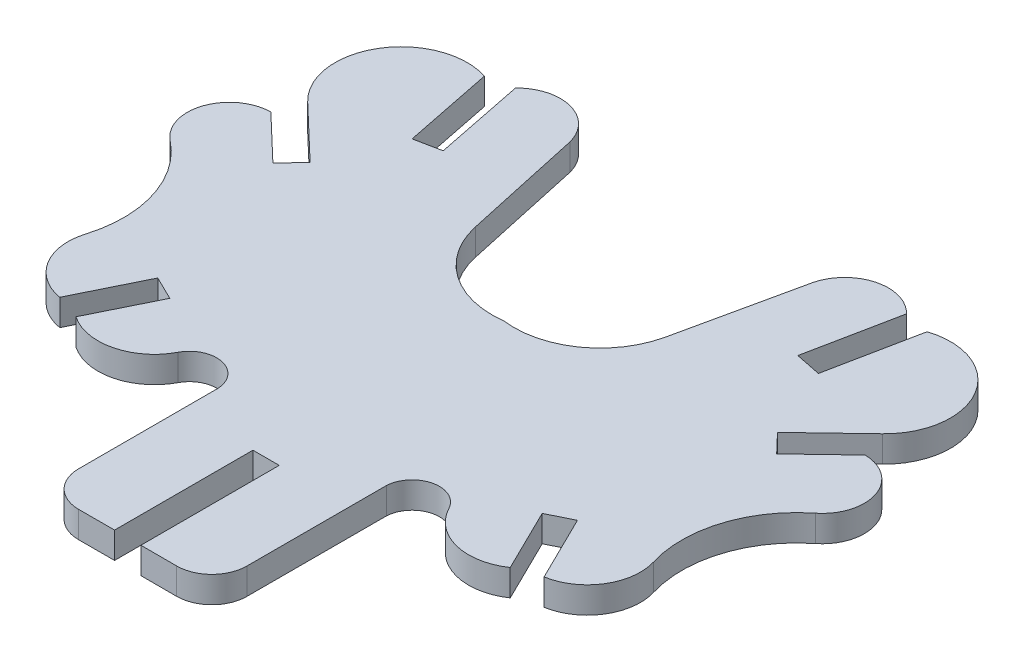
ISO-10303-21;
HEADER;
FILE_DESCRIPTION(('STEP AP214'),'2;1');
FILE_NAME('part.step','',(''),(''),'','','');
FILE_SCHEMA(('AUTOMOTIVE_DESIGN { 1 0 10303 214 1 1 1 1 }'));
ENDSEC;
DATA;
#1=APPLICATION_CONTEXT('core data for automotive mechanical design processes');
#2=APPLICATION_PROTOCOL_DEFINITION('international standard','automotive_design',2000,#1);
#3=PRODUCT_CONTEXT('',#1,'mechanical');
#4=PRODUCT('Part','Part','',(#3));
#5=PRODUCT_RELATED_PRODUCT_CATEGORY('part','',(#4));
#6=PRODUCT_DEFINITION_FORMATION('','',#4);
#7=PRODUCT_DEFINITION_CONTEXT('part definition',#1,'design');
#8=PRODUCT_DEFINITION('design','',#6,#7);
#9=PRODUCT_DEFINITION_SHAPE('','',#8);
#10=(LENGTH_UNIT() NAMED_UNIT(*) SI_UNIT(.MILLI.,.METRE.));
#11=(NAMED_UNIT(*) PLANE_ANGLE_UNIT() SI_UNIT($,.RADIAN.));
#12=(NAMED_UNIT(*) SI_UNIT($,.STERADIAN.) SOLID_ANGLE_UNIT());
#13=UNCERTAINTY_MEASURE_WITH_UNIT(LENGTH_MEASURE(1.E-05),#10,'distance_accuracy_value','');
#14=(GEOMETRIC_REPRESENTATION_CONTEXT(3) GLOBAL_UNCERTAINTY_ASSIGNED_CONTEXT((#13)) GLOBAL_UNIT_ASSIGNED_CONTEXT((#10,
#11,#12)) REPRESENTATION_CONTEXT('',''));
#15=CARTESIAN_POINT('',(0.,0.,0.));
#16=DIRECTION('',(0.,0.,1.));
#17=DIRECTION('',(1.,0.,0.));
#18=AXIS2_PLACEMENT_3D('',#15,#16,#17);
#19=CARTESIAN_POINT('',(-42055.7480056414,3.,-18452.5064075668));
#20=DIRECTION('',(0.,-1.,0.));
#21=DIRECTION('',(0.,0.,-1.));
#22=AXIS2_PLACEMENT_3D('',#19,#20,#21);
#23=CYLINDRICAL_SURFACE('',#22,9.80934651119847);
#24=CARTESIAN_POINT('',(-42055.7480056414,0.,-18452.5064075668));
#25=DIRECTION('',(0.,-1.,0.));
#26=DIRECTION('',(0.,0.,1.));
#27=AXIS2_PLACEMENT_3D('',#24,#25,#26);
#28=CIRCLE('',#27,9.80934651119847);
#29=CARTESIAN_POINT('',(-42054.483593,0.,-18442.7788929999));
#30=VERTEX_POINT('',#29);
#31=CARTESIAN_POINT('',(-42065.332031,0.,-18450.416016));
#32=VERTEX_POINT('',#31);
#33=EDGE_CURVE('E354',#30,#32,#28,.T.);
#34=ORIENTED_EDGE('',*,*,#33,.T.);
#35=DIRECTION('',(0.,-1.,0.));
#36=VECTOR('',#35,1.);
#37=CARTESIAN_POINT('',(-42065.332031,3.,-18450.416016));
#38=LINE('',#37,#36);
#39=CARTESIAN_POINT('',(-42065.332031,3.,-18450.416016));
#40=VERTEX_POINT('',#39);
#41=EDGE_CURVE('E11',#40,#32,#38,.T.);
#42=ORIENTED_EDGE('',*,*,#41,.F.);
#43=CARTESIAN_POINT('',(-42055.7480056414,3.,-18452.5064075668));
#44=DIRECTION('',(0.,-1.,0.));
#45=DIRECTION('',(0.,0.,1.));
#46=AXIS2_PLACEMENT_3D('',#43,#44,#45);
#47=CIRCLE('',#46,9.80934651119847);
#48=CARTESIAN_POINT('',(-42054.483593,3.,-18442.7788929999));
#49=VERTEX_POINT('',#48);
#50=EDGE_CURVE('E442',#49,#40,#47,.T.);
#51=ORIENTED_EDGE('',*,*,#50,.F.);
#52=DIRECTION('',(0.,-1.,0.));
#53=VECTOR('',#52,1.);
#54=CARTESIAN_POINT('',(-42054.483593,3.,-18442.7788929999));
#55=LINE('',#54,#53);
#56=EDGE_CURVE('E350',#49,#30,#55,.T.);
#57=ORIENTED_EDGE('',*,*,#56,.T.);
#58=EDGE_LOOP('',(#34,#42,#51,#57));
#59=FACE_BOUND('',#58,.T.);
#60=ADVANCED_FACE('F36',(#59),#23,.F.);
#61=CARTESIAN_POINT('',(-42068.337831,3.,-18464.194328));
#62=DIRECTION('',(-0.977021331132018,0.,0.213141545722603));
#63=DIRECTION('',(0.213141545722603,0.,0.977021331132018));
#64=AXIS2_PLACEMENT_3D('',#61,#62,#63);
#65=PLANE('',#64);
#66=DIRECTION('',(-0.213141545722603,0.,-0.977021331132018));
#67=VECTOR('',#66,1.);
#68=CARTESIAN_POINT('',(-42068.337831,0.,-18464.194328));
#69=LINE('',#68,#67);
#70=CARTESIAN_POINT('',(-42068.337831,0.,-18464.194328));
#71=VERTEX_POINT('',#70);
#72=EDGE_CURVE('E357',#32,#71,#69,.T.);
#73=ORIENTED_EDGE('',*,*,#72,.T.);
#74=DIRECTION('',(0.,-1.,0.));
#75=VECTOR('',#74,1.);
#76=CARTESIAN_POINT('',(-42068.337831,3.,-18464.194328));
#77=LINE('',#76,#75);
#78=CARTESIAN_POINT('',(-42068.337831,3.,-18464.194328));
#79=VERTEX_POINT('',#78);
#80=EDGE_CURVE('E44',#79,#71,#77,.T.);
#81=ORIENTED_EDGE('',*,*,#80,.F.);
#82=DIRECTION('',(-0.213141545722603,0.,-0.977021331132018));
#83=VECTOR('',#82,1.);
#84=CARTESIAN_POINT('',(-42068.337831,3.,-18464.194328));
#85=LINE('',#84,#83);
#86=EDGE_CURVE('E206',#40,#79,#85,.T.);
#87=ORIENTED_EDGE('',*,*,#86,.F.);
#88=ORIENTED_EDGE('',*,*,#41,.T.);
#89=EDGE_LOOP('',(#73,#81,#87,#88));
#90=FACE_BOUND('',#89,.T.);
#91=ADVANCED_FACE('F685',(#90),#65,.F.);
#92=CARTESIAN_POINT('',(-42073.1638097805,3.,-18462.9706364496));
#93=DIRECTION('',(0.,-1.,0.));
#94=DIRECTION('',(0.,0.,-1.));
#95=AXIS2_PLACEMENT_3D('',#92,#93,#94);
#96=CYLINDRICAL_SURFACE('',#95,4.9787038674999);
#97=CARTESIAN_POINT('',(-42073.1638097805,0.,-18462.9706364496));
#98=DIRECTION('',(0.,1.,0.));
#99=DIRECTION('',(0.,0.,1.));
#100=AXIS2_PLACEMENT_3D('',#97,#98,#99);
#101=CIRCLE('',#100,4.9787038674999);
#102=CARTESIAN_POINT('',(-42076.757812,0.,-18466.416016));
#103=VERTEX_POINT('',#102);
#104=EDGE_CURVE('E359',#71,#103,#101,.T.);
#105=ORIENTED_EDGE('',*,*,#104,.T.);
#106=DIRECTION('',(0.,-1.,0.));
#107=VECTOR('',#106,1.);
#108=CARTESIAN_POINT('',(-42076.757812,3.,-18466.416016));
#109=LINE('',#108,#107);
#110=CARTESIAN_POINT('',(-42076.757812,3.,-18466.416016));
#111=VERTEX_POINT('',#110);
#112=EDGE_CURVE('E560',#111,#103,#109,.T.);
#113=ORIENTED_EDGE('',*,*,#112,.F.);
#114=CARTESIAN_POINT('',(-42073.1638097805,3.,-18462.9706364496));
#115=DIRECTION('',(0.,1.,0.));
#116=DIRECTION('',(0.,0.,1.));
#117=AXIS2_PLACEMENT_3D('',#114,#115,#116);
#118=CIRCLE('',#117,4.9787038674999);
#119=EDGE_CURVE('E568',#79,#111,#118,.T.);
#120=ORIENTED_EDGE('',*,*,#119,.F.);
#121=ORIENTED_EDGE('',*,*,#80,.T.);
#122=EDGE_LOOP('',(#105,#113,#120,#121));
#123=FACE_BOUND('',#122,.T.);
#124=ADVANCED_FACE('F566',(#123),#96,.T.);
#125=CARTESIAN_POINT('',(-42074.683594,3.,-18456.105469));
#126=DIRECTION('',(0.980358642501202,0.,-0.197223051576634));
#127=DIRECTION('',(-0.197223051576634,0.,-0.980358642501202));
#128=AXIS2_PLACEMENT_3D('',#125,#126,#127);
#129=PLANE('',#128);
#130=DIRECTION('',(0.197223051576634,0.,0.980358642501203));
#131=VECTOR('',#130,1.);
#132=CARTESIAN_POINT('',(-42074.683594,0.,-18456.105469));
#133=LINE('',#132,#131);
#134=CARTESIAN_POINT('',(-42074.683594,0.,-18456.105469));
#135=VERTEX_POINT('',#134);
#136=EDGE_CURVE('E361',#103,#135,#133,.T.);
#137=ORIENTED_EDGE('',*,*,#136,.T.);
#138=DIRECTION('',(0.,-1.,0.));
#139=VECTOR('',#138,1.);
#140=CARTESIAN_POINT('',(-42074.683594,3.,-18456.105469));
#141=LINE('',#140,#139);
#142=CARTESIAN_POINT('',(-42074.683594,3.,-18456.105469));
#143=VERTEX_POINT('',#142);
#144=EDGE_CURVE('E557',#143,#135,#141,.T.);
#145=ORIENTED_EDGE('',*,*,#144,.F.);
#146=DIRECTION('',(0.197223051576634,0.,0.980358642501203));
#147=VECTOR('',#146,1.);
#148=CARTESIAN_POINT('',(-42074.683594,3.,-18456.105469));
#149=LINE('',#148,#147);
#150=EDGE_CURVE('E586',#111,#143,#149,.T.);
#151=ORIENTED_EDGE('',*,*,#150,.F.);
#152=ORIENTED_EDGE('',*,*,#112,.T.);
#153=EDGE_LOOP('',(#137,#145,#151,#152));
#154=FACE_BOUND('',#153,.T.);
#155=ADVANCED_FACE('F577',(#154),#129,.F.);
#156=CARTESIAN_POINT('',(-42077.628906,3.,-18455.513672));
#157=DIRECTION('',(0.196991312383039,0.,0.980405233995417));
#158=DIRECTION('',(0.980405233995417,0.,-0.196991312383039));
#159=AXIS2_PLACEMENT_3D('',#156,#157,#158);
#160=PLANE('',#159);
#161=DIRECTION('',(-0.980405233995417,0.,0.196991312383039));
#162=VECTOR('',#161,1.);
#163=CARTESIAN_POINT('',(-42077.628906,0.,-18455.513672));
#164=LINE('',#163,#162);
#165=CARTESIAN_POINT('',(-42077.628906,0.,-18455.513672));
#166=VERTEX_POINT('',#165);
#167=EDGE_CURVE('E363',#135,#166,#164,.T.);
#168=ORIENTED_EDGE('',*,*,#167,.T.);
#169=DIRECTION('',(0.,-1.,0.));
#170=VECTOR('',#169,1.);
#171=CARTESIAN_POINT('',(-42077.628906,3.,-18455.513672));
#172=LINE('',#171,#170);
#173=CARTESIAN_POINT('',(-42077.628906,3.,-18455.513672));
#174=VERTEX_POINT('',#173);
#175=EDGE_CURVE('E554',#174,#166,#172,.T.);
#176=ORIENTED_EDGE('',*,*,#175,.F.);
#177=DIRECTION('',(-0.980405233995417,0.,0.196991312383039));
#178=VECTOR('',#177,1.);
#179=CARTESIAN_POINT('',(-42077.628906,3.,-18455.513672));
#180=LINE('',#179,#178);
#181=EDGE_CURVE('E583',#143,#174,#180,.T.);
#182=ORIENTED_EDGE('',*,*,#181,.F.);
#183=ORIENTED_EDGE('',*,*,#144,.T.);
#184=EDGE_LOOP('',(#168,#176,#182,#183));
#185=FACE_BOUND('',#184,.T.);
#186=ADVANCED_FACE('F581',(#185),#160,.F.);
#187=CARTESIAN_POINT('',(-42079.702157,3.,-18465.822798));
#188=DIRECTION('',(-0.980371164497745,0.,0.197160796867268));
#189=DIRECTION('',(0.197160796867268,0.,0.980371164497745));
#190=AXIS2_PLACEMENT_3D('',#187,#188,#189);
#191=PLANE('',#190);
#192=DIRECTION('',(-0.197160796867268,0.,-0.980371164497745));
#193=VECTOR('',#192,1.);
#194=CARTESIAN_POINT('',(-42079.702157,0.,-18465.822798));
#195=LINE('',#194,#193);
#196=CARTESIAN_POINT('',(-42079.702157,0.,-18465.822798));
#197=VERTEX_POINT('',#196);
#198=EDGE_CURVE('E365',#166,#197,#195,.T.);
#199=ORIENTED_EDGE('',*,*,#198,.T.);
#200=DIRECTION('',(0.,-1.,0.));
#201=VECTOR('',#200,1.);
#202=CARTESIAN_POINT('',(-42079.702157,3.,-18465.822798));
#203=LINE('',#202,#201);
#204=CARTESIAN_POINT('',(-42079.702157,3.,-18465.822798));
#205=VERTEX_POINT('',#204);
#206=EDGE_CURVE('E551',#205,#197,#203,.T.);
#207=ORIENTED_EDGE('',*,*,#206,.F.);
#208=DIRECTION('',(-0.197160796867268,0.,-0.980371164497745));
#209=VECTOR('',#208,1.);
#210=CARTESIAN_POINT('',(-42079.702157,3.,-18465.822798));
#211=LINE('',#210,#209);
#212=EDGE_CURVE('E585',#174,#205,#211,.T.);
#213=ORIENTED_EDGE('',*,*,#212,.F.);
#214=ORIENTED_EDGE('',*,*,#175,.T.);
#215=EDGE_LOOP('',(#199,#207,#213,#214));
#216=FACE_BOUND('',#215,.T.);
#217=ADVANCED_FACE('F698',(#216),#191,.F.);
#218=CARTESIAN_POINT('',(-42082.0156067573,3.,-18458.652374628));
#219=DIRECTION('',(0.,-1.,0.));
#220=DIRECTION('',(0.,0.,-1.));
#221=AXIS2_PLACEMENT_3D('',#218,#219,#220);
#222=CYLINDRICAL_SURFACE('',#221,7.53438923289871);
#223=CARTESIAN_POINT('',(-42082.0156067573,0.,-18458.652374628));
#224=DIRECTION('',(0.,1.,0.));
#225=DIRECTION('',(0.,0.,1.));
#226=AXIS2_PLACEMENT_3D('',#223,#224,#225);
#227=CIRCLE('',#226,7.53438923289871);
#228=CARTESIAN_POINT('',(-42087.21875,0.,-18453.203125));
#229=VERTEX_POINT('',#228);
#230=EDGE_CURVE('E367',#197,#229,#227,.T.);
#231=ORIENTED_EDGE('',*,*,#230,.T.);
#232=DIRECTION('',(0.,-1.,0.));
#233=VECTOR('',#232,1.);
#234=CARTESIAN_POINT('',(-42087.21875,3.,-18453.203125));
#235=LINE('',#234,#233);
#236=CARTESIAN_POINT('',(-42087.21875,3.,-18453.203125));
#237=VERTEX_POINT('',#236);
#238=EDGE_CURVE('E548',#237,#229,#235,.T.);
#239=ORIENTED_EDGE('',*,*,#238,.F.);
#240=CARTESIAN_POINT('',(-42082.0156067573,3.,-18458.652374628));
#241=DIRECTION('',(0.,1.,0.));
#242=DIRECTION('',(0.,0.,1.));
#243=AXIS2_PLACEMENT_3D('',#240,#241,#242);
#244=CIRCLE('',#243,7.53438923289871);
#245=EDGE_CURVE('E588',#205,#237,#244,.T.);
#246=ORIENTED_EDGE('',*,*,#245,.F.);
#247=ORIENTED_EDGE('',*,*,#206,.T.);
#248=EDGE_LOOP('',(#231,#239,#246,#247));
#249=FACE_BOUND('',#248,.T.);
#250=ADVANCED_FACE('F701',(#249),#222,.T.);
#251=CARTESIAN_POINT('',(-42081.109375,3.,-18447.371094));
#252=DIRECTION('',(0.690497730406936,0.,-0.723334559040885));
#253=DIRECTION('',(-0.723334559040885,0.,-0.690497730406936));
#254=AXIS2_PLACEMENT_3D('',#251,#252,#253);
#255=PLANE('',#254);
#256=DIRECTION('',(0.723334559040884,0.,0.690497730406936));
#257=VECTOR('',#256,1.);
#258=CARTESIAN_POINT('',(-42081.109375,0.,-18447.371094));
#259=LINE('',#258,#257);
#260=CARTESIAN_POINT('',(-42081.109375,0.,-18447.371094));
#261=VERTEX_POINT('',#260);
#262=EDGE_CURVE('E369',#229,#261,#259,.T.);
#263=ORIENTED_EDGE('',*,*,#262,.T.);
#264=DIRECTION('',(0.,-1.,0.));
#265=VECTOR('',#264,1.);
#266=CARTESIAN_POINT('',(-42081.109375,3.,-18447.371094));
#267=LINE('',#266,#265);
#268=CARTESIAN_POINT('',(-42081.109375,3.,-18447.371094));
#269=VERTEX_POINT('',#268);
#270=EDGE_CURVE('E545',#269,#261,#267,.T.);
#271=ORIENTED_EDGE('',*,*,#270,.F.);
#272=DIRECTION('',(0.723334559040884,0.,0.690497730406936));
#273=VECTOR('',#272,1.);
#274=CARTESIAN_POINT('',(-42081.109375,3.,-18447.371094));
#275=LINE('',#274,#273);
#276=EDGE_CURVE('E594',#237,#269,#275,.T.);
#277=ORIENTED_EDGE('',*,*,#276,.F.);
#278=ORIENTED_EDGE('',*,*,#238,.T.);
#279=EDGE_LOOP('',(#263,#271,#277,#278));
#280=FACE_BOUND('',#279,.T.);
#281=ADVANCED_FACE('F705',(#280),#255,.F.);
#282=CARTESIAN_POINT('',(-42083.179687,3.,-18445.199219));
#283=DIRECTION('',(0.723828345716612,0.,0.689980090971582));
#284=DIRECTION('',(0.689980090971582,0.,-0.723828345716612));
#285=AXIS2_PLACEMENT_3D('',#282,#283,#284);
#286=PLANE('',#285);
#287=DIRECTION('',(-0.689980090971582,0.,0.723828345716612));
#288=VECTOR('',#287,1.);
#289=CARTESIAN_POINT('',(-42083.179687,0.,-18445.199219));
#290=LINE('',#289,#288);
#291=CARTESIAN_POINT('',(-42083.179687,0.,-18445.199219));
#292=VERTEX_POINT('',#291);
#293=EDGE_CURVE('E371',#261,#292,#290,.T.);
#294=ORIENTED_EDGE('',*,*,#293,.T.);
#295=DIRECTION('',(0.,-1.,0.));
#296=VECTOR('',#295,1.);
#297=CARTESIAN_POINT('',(-42083.179687,3.,-18445.199219));
#298=LINE('',#297,#296);
#299=CARTESIAN_POINT('',(-42083.179687,3.,-18445.199219));
#300=VERTEX_POINT('',#299);
#301=EDGE_CURVE('E542',#300,#292,#298,.T.);
#302=ORIENTED_EDGE('',*,*,#301,.F.);
#303=DIRECTION('',(-0.689980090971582,0.,0.723828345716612));
#304=VECTOR('',#303,1.);
#305=CARTESIAN_POINT('',(-42083.179687,3.,-18445.199219));
#306=LINE('',#305,#304);
#307=EDGE_CURVE('E596',#269,#300,#306,.T.);
#308=ORIENTED_EDGE('',*,*,#307,.F.);
#309=ORIENTED_EDGE('',*,*,#270,.T.);
#310=EDGE_LOOP('',(#294,#302,#308,#309));
#311=FACE_BOUND('',#310,.T.);
#312=ADVANCED_FACE('F709',(#311),#286,.F.);
#313=CARTESIAN_POINT('',(-42088.333601,3.,-18450.1214760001));
#314=DIRECTION('',(-0.69066747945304,0.,0.723172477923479));
#315=DIRECTION('',(0.723172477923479,0.,0.69066747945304));
#316=AXIS2_PLACEMENT_3D('',#313,#314,#315);
#317=PLANE('',#316);
#318=DIRECTION('',(-0.723172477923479,0.,-0.69066747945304));
#319=VECTOR('',#318,1.);
#320=CARTESIAN_POINT('',(-42088.333601,0.,-18450.1214760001));
#321=LINE('',#320,#319);
#322=CARTESIAN_POINT('',(-42088.333601,0.,-18450.1214760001));
#323=VERTEX_POINT('',#322);
#324=EDGE_CURVE('E373',#292,#323,#321,.T.);
#325=ORIENTED_EDGE('',*,*,#324,.T.);
#326=DIRECTION('',(0.,-1.,0.));
#327=VECTOR('',#326,1.);
#328=CARTESIAN_POINT('',(-42088.333601,3.,-18450.1214760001));
#329=LINE('',#328,#327);
#330=CARTESIAN_POINT('',(-42088.333601,3.,-18450.1214760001));
#331=VERTEX_POINT('',#330);
#332=EDGE_CURVE('E539',#331,#323,#329,.T.);
#333=ORIENTED_EDGE('',*,*,#332,.F.);
#334=DIRECTION('',(-0.723172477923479,0.,-0.69066747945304));
#335=VECTOR('',#334,1.);
#336=CARTESIAN_POINT('',(-42088.333601,3.,-18450.1214760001));
#337=LINE('',#336,#335);
#338=EDGE_CURVE('E598',#300,#331,#337,.T.);
#339=ORIENTED_EDGE('',*,*,#338,.F.);
#340=ORIENTED_EDGE('',*,*,#301,.T.);
#341=EDGE_LOOP('',(#325,#333,#339,#340));
#342=FACE_BOUND('',#341,.T.);
#343=ADVANCED_FACE('F713',(#342),#317,.F.);
#344=CARTESIAN_POINT('',(-42088.2577757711,3.,-18445.3204188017));
#345=DIRECTION('',(0.,-1.,0.));
#346=DIRECTION('',(0.,0.,-1.));
#347=AXIS2_PLACEMENT_3D('',#344,#345,#346);
#348=CYLINDRICAL_SURFACE('',#347,4.80165593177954);
#349=CARTESIAN_POINT('',(-42088.2577757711,0.,-18445.3204188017));
#350=DIRECTION('',(0.,1.,0.));
#351=DIRECTION('',(0.,0.,1.));
#352=AXIS2_PLACEMENT_3D('',#349,#350,#351);
#353=CIRCLE('',#352,4.80165593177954);
#354=CARTESIAN_POINT('',(-42091.239027,0.,-18441.556373));
#355=VERTEX_POINT('',#354);
#356=EDGE_CURVE('E375',#323,#355,#353,.T.);
#357=ORIENTED_EDGE('',*,*,#356,.T.);
#358=DIRECTION('',(0.,-1.,0.));
#359=VECTOR('',#358,1.);
#360=CARTESIAN_POINT('',(-42091.239027,3.,-18441.556373));
#361=LINE('',#360,#359);
#362=CARTESIAN_POINT('',(-42091.239027,3.,-18441.556373));
#363=VERTEX_POINT('',#362);
#364=EDGE_CURVE('E536',#363,#355,#361,.T.);
#365=ORIENTED_EDGE('',*,*,#364,.F.);
#366=CARTESIAN_POINT('',(-42088.2577757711,3.,-18445.3204188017));
#367=DIRECTION('',(0.,1.,0.));
#368=DIRECTION('',(0.,0.,1.));
#369=AXIS2_PLACEMENT_3D('',#366,#367,#368);
#370=CIRCLE('',#369,4.80165593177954);
#371=EDGE_CURVE('E600',#331,#363,#370,.T.);
#372=ORIENTED_EDGE('',*,*,#371,.F.);
#373=ORIENTED_EDGE('',*,*,#332,.T.);
#374=EDGE_LOOP('',(#357,#365,#372,#373));
#375=FACE_BOUND('',#374,.T.);
#376=ADVANCED_FACE('F717',(#375),#348,.T.);
#377=CARTESIAN_POINT('',(-42099.3521537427,3.,-18431.3065743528));
#378=DIRECTION('',(0.,-1.,0.));
#379=DIRECTION('',(0.,0.,-1.));
#380=AXIS2_PLACEMENT_3D('',#377,#378,#379);
#381=CYLINDRICAL_SURFACE('',#380,13.0721535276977);
#382=CARTESIAN_POINT('',(-42099.3521537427,0.,-18431.3065743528));
#383=DIRECTION('',(0.,-1.,0.));
#384=DIRECTION('',(0.,0.,1.));
#385=AXIS2_PLACEMENT_3D('',#382,#383,#384);
#386=CIRCLE('',#385,13.0721535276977);
#387=CARTESIAN_POINT('',(-42086.839337,0.,-18427.523637));
#388=VERTEX_POINT('',#387);
#389=EDGE_CURVE('E377',#355,#388,#386,.T.);
#390=ORIENTED_EDGE('',*,*,#389,.T.);
#391=DIRECTION('',(0.,-1.,0.));
#392=VECTOR('',#391,1.);
#393=CARTESIAN_POINT('',(-42086.839337,3.,-18427.523637));
#394=LINE('',#393,#392);
#395=CARTESIAN_POINT('',(-42086.839337,3.,-18427.523637));
#396=VERTEX_POINT('',#395);
#397=EDGE_CURVE('E533',#396,#388,#394,.T.);
#398=ORIENTED_EDGE('',*,*,#397,.F.);
#399=CARTESIAN_POINT('',(-42099.3521537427,3.,-18431.3065743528));
#400=DIRECTION('',(0.,-1.,0.));
#401=DIRECTION('',(0.,0.,1.));
#402=AXIS2_PLACEMENT_3D('',#399,#400,#401);
#403=CIRCLE('',#402,13.0721535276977);
#404=EDGE_CURVE('E602',#363,#396,#403,.T.);
#405=ORIENTED_EDGE('',*,*,#404,.F.);
#406=ORIENTED_EDGE('',*,*,#364,.T.);
#407=EDGE_LOOP('',(#390,#398,#405,#406));
#408=FACE_BOUND('',#407,.T.);
#409=ADVANCED_FACE('F721',(#408),#381,.F.);
#410=CARTESIAN_POINT('',(-42081.0505022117,3.,-18425.7729858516));
#411=DIRECTION('',(0.,-1.,0.));
#412=DIRECTION('',(0.,0.,-1.));
#413=AXIS2_PLACEMENT_3D('',#410,#411,#412);
#414=CYLINDRICAL_SURFACE('',#413,6.04775889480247);
#415=CARTESIAN_POINT('',(-42081.0505022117,0.,-18425.7729858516));
#416=DIRECTION('',(0.,1.,0.));
#417=DIRECTION('',(0.,0.,1.));
#418=AXIS2_PLACEMENT_3D('',#415,#416,#417);
#419=CIRCLE('',#418,6.04775889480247);
#420=CARTESIAN_POINT('',(-42082.074219,0.,-18419.8125));
#421=VERTEX_POINT('',#420);
#422=EDGE_CURVE('E379',#388,#421,#419,.T.);
#423=ORIENTED_EDGE('',*,*,#422,.T.);
#424=DIRECTION('',(0.,-1.,0.));
#425=VECTOR('',#424,1.);
#426=CARTESIAN_POINT('',(-42082.074219,3.,-18419.8125));
#427=LINE('',#426,#425);
#428=CARTESIAN_POINT('',(-42082.074219,3.,-18419.8125));
#429=VERTEX_POINT('',#428);
#430=EDGE_CURVE('E530',#429,#421,#427,.T.);
#431=ORIENTED_EDGE('',*,*,#430,.F.);
#432=CARTESIAN_POINT('',(-42081.0505022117,3.,-18425.7729858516));
#433=DIRECTION('',(0.,1.,0.));
#434=DIRECTION('',(0.,0.,1.));
#435=AXIS2_PLACEMENT_3D('',#432,#433,#434);
#436=CIRCLE('',#435,6.04775889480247);
#437=EDGE_CURVE('E604',#396,#429,#436,.T.);
#438=ORIENTED_EDGE('',*,*,#437,.F.);
#439=ORIENTED_EDGE('',*,*,#397,.T.);
#440=EDGE_LOOP('',(#423,#431,#438,#439));
#441=FACE_BOUND('',#440,.T.);
#442=ADVANCED_FACE('F725',(#441),#414,.T.);
#443=CARTESIAN_POINT('',(-42078.394531,3.,-18427.298828));
#444=DIRECTION('',(-0.897450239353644,0.,-0.441115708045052));
#445=DIRECTION('',(-0.441115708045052,0.,0.897450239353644));
#446=AXIS2_PLACEMENT_3D('',#443,#444,#445);
#447=PLANE('',#446);
#448=DIRECTION('',(0.441115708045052,0.,-0.897450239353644));
#449=VECTOR('',#448,1.);
#450=CARTESIAN_POINT('',(-42078.394531,0.,-18427.298828));
#451=LINE('',#450,#449);
#452=CARTESIAN_POINT('',(-42078.394531,0.,-18427.298828));
#453=VERTEX_POINT('',#452);
#454=EDGE_CURVE('E381',#421,#453,#451,.T.);
#455=ORIENTED_EDGE('',*,*,#454,.T.);
#456=DIRECTION('',(0.,-1.,0.));
#457=VECTOR('',#456,1.);
#458=CARTESIAN_POINT('',(-42078.394531,3.,-18427.298828));
#459=LINE('',#458,#457);
#460=CARTESIAN_POINT('',(-42078.394531,3.,-18427.298828));
#461=VERTEX_POINT('',#460);
#462=EDGE_CURVE('E527',#461,#453,#459,.T.);
#463=ORIENTED_EDGE('',*,*,#462,.F.);
#464=DIRECTION('',(0.441115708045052,0.,-0.897450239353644));
#465=VECTOR('',#464,1.);
#466=CARTESIAN_POINT('',(-42078.394531,3.,-18427.298828));
#467=LINE('',#466,#465);
#468=EDGE_CURVE('E606',#429,#461,#467,.T.);
#469=ORIENTED_EDGE('',*,*,#468,.F.);
#470=ORIENTED_EDGE('',*,*,#430,.T.);
#471=EDGE_LOOP('',(#455,#463,#469,#470));
#472=FACE_BOUND('',#471,.T.);
#473=ADVANCED_FACE('F729',(#472),#447,.F.);
#474=CARTESIAN_POINT('',(-42075.699219,3.,-18425.974609));
#475=DIRECTION('',(0.440959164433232,0.,-0.897527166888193));
#476=DIRECTION('',(-0.897527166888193,0.,-0.440959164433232));
#477=AXIS2_PLACEMENT_3D('',#474,#475,#476);
#478=PLANE('',#477);
#479=DIRECTION('',(0.897527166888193,0.,0.440959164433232));
#480=VECTOR('',#479,1.);
#481=CARTESIAN_POINT('',(-42075.699219,0.,-18425.974609));
#482=LINE('',#481,#480);
#483=CARTESIAN_POINT('',(-42075.699219,0.,-18425.974609));
#484=VERTEX_POINT('',#483);
#485=EDGE_CURVE('E383',#453,#484,#482,.T.);
#486=ORIENTED_EDGE('',*,*,#485,.T.);
#487=DIRECTION('',(0.,-1.,0.));
#488=VECTOR('',#487,1.);
#489=CARTESIAN_POINT('',(-42075.699219,3.,-18425.974609));
#490=LINE('',#489,#488);
#491=CARTESIAN_POINT('',(-42075.699219,3.,-18425.974609));
#492=VERTEX_POINT('',#491);
#493=EDGE_CURVE('E524',#492,#484,#490,.T.);
#494=ORIENTED_EDGE('',*,*,#493,.F.);
#495=DIRECTION('',(0.897527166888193,0.,0.440959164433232));
#496=VECTOR('',#495,1.);
#497=CARTESIAN_POINT('',(-42075.699219,3.,-18425.974609));
#498=LINE('',#497,#496);
#499=EDGE_CURVE('E608',#461,#492,#498,.T.);
#500=ORIENTED_EDGE('',*,*,#499,.F.);
#501=ORIENTED_EDGE('',*,*,#462,.T.);
#502=EDGE_LOOP('',(#486,#494,#500,#501));
#503=FACE_BOUND('',#502,.T.);
#504=ADVANCED_FACE('F733',(#503),#478,.F.);
#505=CARTESIAN_POINT('',(-42079.222912,3.,-18418.8100639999));
#506=DIRECTION('',(0.897342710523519,0.,0.441334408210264));
#507=DIRECTION('',(0.441334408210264,0.,-0.897342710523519));
#508=AXIS2_PLACEMENT_3D('',#505,#506,#507);
#509=PLANE('',#508);
#510=DIRECTION('',(-0.441334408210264,0.,0.897342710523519));
#511=VECTOR('',#510,1.);
#512=CARTESIAN_POINT('',(-42079.222912,0.,-18418.8100639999));
#513=LINE('',#512,#511);
#514=CARTESIAN_POINT('',(-42079.222912,0.,-18418.8100639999));
#515=VERTEX_POINT('',#514);
#516=EDGE_CURVE('E385',#484,#515,#513,.T.);
#517=ORIENTED_EDGE('',*,*,#516,.T.);
#518=DIRECTION('',(0.,-1.,0.));
#519=VECTOR('',#518,1.);
#520=CARTESIAN_POINT('',(-42079.222912,3.,-18418.8100639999));
#521=LINE('',#520,#519);
#522=CARTESIAN_POINT('',(-42079.222912,3.,-18418.8100639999));
#523=VERTEX_POINT('',#522);
#524=EDGE_CURVE('E521',#523,#515,#521,.T.);
#525=ORIENTED_EDGE('',*,*,#524,.F.);
#526=DIRECTION('',(-0.441334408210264,0.,0.897342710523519));
#527=VECTOR('',#526,1.);
#528=CARTESIAN_POINT('',(-42079.222912,3.,-18418.8100639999));
#529=LINE('',#528,#527);
#530=EDGE_CURVE('E610',#492,#523,#529,.T.);
#531=ORIENTED_EDGE('',*,*,#530,.F.);
#532=ORIENTED_EDGE('',*,*,#493,.T.);
#533=EDGE_LOOP('',(#517,#525,#531,#532));
#534=FACE_BOUND('',#533,.T.);
#535=ADVANCED_FACE('F737',(#534),#509,.F.);
#536=CARTESIAN_POINT('',(-42075.595417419,3.,-18424.1157905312));
#537=DIRECTION('',(0.,-1.,0.));
#538=DIRECTION('',(0.,0.,-1.));
#539=AXIS2_PLACEMENT_3D('',#536,#537,#538);
#540=CYLINDRICAL_SURFACE('',#539,6.42724287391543);
#541=CARTESIAN_POINT('',(-42075.595417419,0.,-18424.1157905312));
#542=DIRECTION('',(0.,1.,0.));
#543=DIRECTION('',(0.,0.,1.));
#544=AXIS2_PLACEMENT_3D('',#541,#542,#543);
#545=CIRCLE('',#544,6.42724287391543);
#546=CARTESIAN_POINT('',(-42069.9056849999,0.,-18421.12641));
#547=VERTEX_POINT('',#546);
#548=EDGE_CURVE('E387',#515,#547,#545,.T.);
#549=ORIENTED_EDGE('',*,*,#548,.T.);
#550=DIRECTION('',(0.,-1.,0.));
#551=VECTOR('',#550,1.);
#552=CARTESIAN_POINT('',(-42069.9056849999,3.,-18421.12641));
#553=LINE('',#552,#551);
#554=CARTESIAN_POINT('',(-42069.9056849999,3.,-18421.12641));
#555=VERTEX_POINT('',#554);
#556=EDGE_CURVE('E518',#555,#547,#553,.T.);
#557=ORIENTED_EDGE('',*,*,#556,.F.);
#558=CARTESIAN_POINT('',(-42075.595417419,3.,-18424.1157905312));
#559=DIRECTION('',(0.,1.,0.));
#560=DIRECTION('',(0.,0.,1.));
#561=AXIS2_PLACEMENT_3D('',#558,#559,#560);
#562=CIRCLE('',#561,6.42724287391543);
#563=EDGE_CURVE('E612',#523,#555,#562,.T.);
#564=ORIENTED_EDGE('',*,*,#563,.F.);
#565=ORIENTED_EDGE('',*,*,#524,.T.);
#566=EDGE_LOOP('',(#549,#557,#564,#565));
#567=FACE_BOUND('',#566,.T.);
#568=ADVANCED_FACE('F741',(#567),#540,.T.);
#569=CARTESIAN_POINT('',(-42067.1647369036,3.,-18419.6876459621));
#570=DIRECTION('',(0.,-1.,0.));
#571=DIRECTION('',(0.,0.,-1.));
#572=AXIS2_PLACEMENT_3D('',#569,#570,#571);
#573=CYLINDRICAL_SURFACE('',#572,3.09561600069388);
#574=CARTESIAN_POINT('',(-42067.1647369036,0.,-18419.6876459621));
#575=DIRECTION('',(0.,-1.,0.));
#576=DIRECTION('',(0.,0.,1.));
#577=AXIS2_PLACEMENT_3D('',#574,#575,#576);
#578=CIRCLE('',#577,3.09561600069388);
#579=CARTESIAN_POINT('',(-42064.074219,0.,-18419.865234));
#580=VERTEX_POINT('',#579);
#581=EDGE_CURVE('E389',#547,#580,#578,.T.);
#582=ORIENTED_EDGE('',*,*,#581,.T.);
#583=DIRECTION('',(0.,-1.,0.));
#584=VECTOR('',#583,1.);
#585=CARTESIAN_POINT('',(-42064.074219,3.,-18419.865234));
#586=LINE('',#585,#584);
#587=CARTESIAN_POINT('',(-42064.074219,3.,-18419.865234));
#588=VERTEX_POINT('',#587);
#589=EDGE_CURVE('E515',#588,#580,#586,.T.);
#590=ORIENTED_EDGE('',*,*,#589,.F.);
#591=CARTESIAN_POINT('',(-42067.1647369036,3.,-18419.6876459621));
#592=DIRECTION('',(0.,-1.,0.));
#593=DIRECTION('',(0.,0.,1.));
#594=AXIS2_PLACEMENT_3D('',#591,#592,#593);
#595=CIRCLE('',#594,3.09561600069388);
#596=EDGE_CURVE('E614',#555,#588,#595,.T.);
#597=ORIENTED_EDGE('',*,*,#596,.F.);
#598=ORIENTED_EDGE('',*,*,#556,.T.);
#599=EDGE_LOOP('',(#582,#590,#597,#598));
#600=FACE_BOUND('',#599,.T.);
#601=ADVANCED_FACE('F745',(#600),#573,.F.);
#602=CARTESIAN_POINT('',(-42064.074219,3.,-18403.96262));
#603=DIRECTION('',(1.,0.,-1.78723506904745E-12));
#604=DIRECTION('',(-1.78723506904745E-12,0.,-1.));
#605=AXIS2_PLACEMENT_3D('',#602,#603,#604);
#606=PLANE('',#605);
#607=DIRECTION('',(1.78723506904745E-12,0.,1.));
#608=VECTOR('',#607,1.);
#609=CARTESIAN_POINT('',(-42064.074219,0.,-18403.96262));
#610=LINE('',#609,#608);
#611=CARTESIAN_POINT('',(-42064.074219,0.,-18403.96262));
#612=VERTEX_POINT('',#611);
#613=EDGE_CURVE('E391',#580,#612,#610,.T.);
#614=ORIENTED_EDGE('',*,*,#613,.T.);
#615=DIRECTION('',(0.,-1.,0.));
#616=VECTOR('',#615,1.);
#617=CARTESIAN_POINT('',(-42064.074219,3.,-18403.96262));
#618=LINE('',#617,#616);
#619=CARTESIAN_POINT('',(-42064.074219,3.,-18403.96262));
#620=VERTEX_POINT('',#619);
#621=EDGE_CURVE('E512',#620,#612,#618,.T.);
#622=ORIENTED_EDGE('',*,*,#621,.F.);
#623=DIRECTION('',(1.78723506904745E-12,0.,1.));
#624=VECTOR('',#623,1.);
#625=CARTESIAN_POINT('',(-42064.074219,3.,-18403.96262));
#626=LINE('',#625,#624);
#627=EDGE_CURVE('E616',#588,#620,#626,.T.);
#628=ORIENTED_EDGE('',*,*,#627,.F.);
#629=ORIENTED_EDGE('',*,*,#589,.T.);
#630=EDGE_LOOP('',(#614,#622,#628,#629));
#631=FACE_BOUND('',#630,.T.);
#632=ADVANCED_FACE('F749',(#631),#606,.F.);
#633=CARTESIAN_POINT('',(-42060.073242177,3.,-18403.961913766));
#634=DIRECTION('',(0.,-1.,0.));
#635=DIRECTION('',(0.,0.,-1.));
#636=AXIS2_PLACEMENT_3D('',#633,#634,#635);
#637=CYLINDRICAL_SURFACE('',#636,4.00097688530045);
#638=CARTESIAN_POINT('',(-42060.073242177,0.,-18403.961913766));
#639=DIRECTION('',(0.,1.,0.));
#640=DIRECTION('',(0.,0.,1.));
#641=AXIS2_PLACEMENT_3D('',#638,#639,#640);
#642=CIRCLE('',#641,4.00097688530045);
#643=CARTESIAN_POINT('',(-42060.074219,0.,-18399.9609369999));
#644=VERTEX_POINT('',#643);
#645=EDGE_CURVE('E393',#612,#644,#642,.T.);
#646=ORIENTED_EDGE('',*,*,#645,.T.);
#647=DIRECTION('',(0.,-1.,0.));
#648=VECTOR('',#647,1.);
#649=CARTESIAN_POINT('',(-42060.074219,3.,-18399.9609369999));
#650=LINE('',#649,#648);
#651=CARTESIAN_POINT('',(-42060.074219,3.,-18399.9609369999));
#652=VERTEX_POINT('',#651);
#653=EDGE_CURVE('E509',#652,#644,#650,.T.);
#654=ORIENTED_EDGE('',*,*,#653,.F.);
#655=CARTESIAN_POINT('',(-42060.073242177,3.,-18403.961913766));
#656=DIRECTION('',(0.,1.,0.));
#657=DIRECTION('',(0.,0.,1.));
#658=AXIS2_PLACEMENT_3D('',#655,#656,#657);
#659=CIRCLE('',#658,4.00097688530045);
#660=EDGE_CURVE('E618',#620,#652,#659,.T.);
#661=ORIENTED_EDGE('',*,*,#660,.F.);
#662=ORIENTED_EDGE('',*,*,#621,.T.);
#663=EDGE_LOOP('',(#646,#654,#661,#662));
#664=FACE_BOUND('',#663,.T.);
#665=ADVANCED_FACE('F753',(#664),#637,.T.);
#666=CARTESIAN_POINT('',(-42055.980469,3.,-18399.962891));
#667=DIRECTION('',(-0.000477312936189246,0.,-0.999999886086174));
#668=DIRECTION('',(-0.999999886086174,0.,0.000477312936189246));
#669=AXIS2_PLACEMENT_3D('',#666,#667,#668);
#670=PLANE('',#669);
#671=DIRECTION('',(0.999999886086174,0.,-0.000477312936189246));
#672=VECTOR('',#671,1.);
#673=CARTESIAN_POINT('',(-42055.980469,0.,-18399.962891));
#674=LINE('',#673,#672);
#675=CARTESIAN_POINT('',(-42055.980469,0.,-18399.962891));
#676=VERTEX_POINT('',#675);
#677=EDGE_CURVE('E395',#644,#676,#674,.T.);
#678=ORIENTED_EDGE('',*,*,#677,.T.);
#679=DIRECTION('',(0.,-1.,0.));
#680=VECTOR('',#679,1.);
#681=CARTESIAN_POINT('',(-42055.980469,3.,-18399.962891));
#682=LINE('',#681,#680);
#683=CARTESIAN_POINT('',(-42055.980469,3.,-18399.962891));
#684=VERTEX_POINT('',#683);
#685=EDGE_CURVE('E506',#684,#676,#682,.T.);
#686=ORIENTED_EDGE('',*,*,#685,.F.);
#687=DIRECTION('',(0.999999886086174,0.,-0.000477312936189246));
#688=VECTOR('',#687,1.);
#689=CARTESIAN_POINT('',(-42055.980469,3.,-18399.962891));
#690=LINE('',#689,#688);
#691=EDGE_CURVE('E620',#652,#684,#690,.T.);
#692=ORIENTED_EDGE('',*,*,#691,.F.);
#693=ORIENTED_EDGE('',*,*,#653,.T.);
#694=EDGE_LOOP('',(#678,#686,#692,#693));
#695=FACE_BOUND('',#694,.T.);
#696=ADVANCED_FACE('F757',(#695),#670,.F.);
#697=CARTESIAN_POINT('',(-42055.980469,3.,-18415.726562));
#698=DIRECTION('',(-1.,0.,0.));
#699=DIRECTION('',(0.,0.,1.));
#700=AXIS2_PLACEMENT_3D('',#697,#698,#699);
#701=PLANE('',#700);
#702=DIRECTION('',(0.,0.,-1.));
#703=VECTOR('',#702,1.);
#704=CARTESIAN_POINT('',(-42055.980469,0.,-18415.726562));
#705=LINE('',#704,#703);
#706=CARTESIAN_POINT('',(-42055.980469,0.,-18415.726562));
#707=VERTEX_POINT('',#706);
#708=EDGE_CURVE('E397',#676,#707,#705,.T.);
#709=ORIENTED_EDGE('',*,*,#708,.T.);
#710=DIRECTION('',(0.,-1.,0.));
#711=VECTOR('',#710,1.);
#712=CARTESIAN_POINT('',(-42055.980469,3.,-18415.726562));
#713=LINE('',#712,#711);
#714=CARTESIAN_POINT('',(-42055.980469,3.,-18415.726562));
#715=VERTEX_POINT('',#714);
#716=EDGE_CURVE('E503',#715,#707,#713,.T.);
#717=ORIENTED_EDGE('',*,*,#716,.F.);
#718=DIRECTION('',(0.,0.,-1.));
#719=VECTOR('',#718,1.);
#720=CARTESIAN_POINT('',(-42055.980469,3.,-18415.726562));
#721=LINE('',#720,#719);
#722=EDGE_CURVE('E622',#684,#715,#721,.T.);
#723=ORIENTED_EDGE('',*,*,#722,.F.);
#724=ORIENTED_EDGE('',*,*,#685,.T.);
#725=EDGE_LOOP('',(#709,#717,#723,#724));
#726=FACE_BOUND('',#725,.T.);
#727=ADVANCED_FACE('F761',(#726),#701,.F.);
#728=CARTESIAN_POINT('',(-42052.984375,3.,-18415.726562));
#729=DIRECTION('',(0.,0.,-1.));
#730=DIRECTION('',(-1.,0.,0.));
#731=AXIS2_PLACEMENT_3D('',#728,#729,#730);
#732=PLANE('',#731);
#733=DIRECTION('',(1.,0.,0.));
#734=VECTOR('',#733,1.);
#735=CARTESIAN_POINT('',(-42052.984375,0.,-18415.726562));
#736=LINE('',#735,#734);
#737=CARTESIAN_POINT('',(-42052.984375,0.,-18415.726562));
#738=VERTEX_POINT('',#737);
#739=EDGE_CURVE('E399',#707,#738,#736,.T.);
#740=ORIENTED_EDGE('',*,*,#739,.T.);
#741=DIRECTION('',(0.,-1.,0.));
#742=VECTOR('',#741,1.);
#743=CARTESIAN_POINT('',(-42052.984375,3.,-18415.726562));
#744=LINE('',#743,#742);
#745=CARTESIAN_POINT('',(-42052.984375,3.,-18415.726562));
#746=VERTEX_POINT('',#745);
#747=EDGE_CURVE('E500',#746,#738,#744,.T.);
#748=ORIENTED_EDGE('',*,*,#747,.F.);
#749=DIRECTION('',(1.,0.,0.));
#750=VECTOR('',#749,1.);
#751=CARTESIAN_POINT('',(-42052.984375,3.,-18415.726562));
#752=LINE('',#751,#750);
#753=EDGE_CURVE('E624',#715,#746,#752,.T.);
#754=ORIENTED_EDGE('',*,*,#753,.F.);
#755=ORIENTED_EDGE('',*,*,#716,.T.);
#756=EDGE_LOOP('',(#740,#748,#754,#755));
#757=FACE_BOUND('',#756,.T.);
#758=ADVANCED_FACE('F765',(#757),#732,.F.);
#759=CARTESIAN_POINT('',(-42052.984375,3.,-18399.964844));
#760=DIRECTION('',(1.,0.,0.));
#761=DIRECTION('',(0.,0.,-1.));
#762=AXIS2_PLACEMENT_3D('',#759,#760,#761);
#763=PLANE('',#762);
#764=DIRECTION('',(0.,0.,1.));
#765=VECTOR('',#764,1.);
#766=CARTESIAN_POINT('',(-42052.984375,0.,-18399.964844));
#767=LINE('',#766,#765);
#768=CARTESIAN_POINT('',(-42052.984375,0.,-18399.964844));
#769=VERTEX_POINT('',#768);
#770=EDGE_CURVE('E401',#738,#769,#767,.T.);
#771=ORIENTED_EDGE('',*,*,#770,.T.);
#772=DIRECTION('',(0.,-1.,0.));
#773=VECTOR('',#772,1.);
#774=CARTESIAN_POINT('',(-42052.984375,3.,-18399.964844));
#775=LINE('',#774,#773);
#776=CARTESIAN_POINT('',(-42052.984375,3.,-18399.964844));
#777=VERTEX_POINT('',#776);
#778=EDGE_CURVE('E497',#777,#769,#775,.T.);
#779=ORIENTED_EDGE('',*,*,#778,.F.);
#780=DIRECTION('',(0.,0.,1.));
#781=VECTOR('',#780,1.);
#782=CARTESIAN_POINT('',(-42052.984375,3.,-18399.964844));
#783=LINE('',#782,#781);
#784=EDGE_CURVE('E626',#746,#777,#783,.T.);
#785=ORIENTED_EDGE('',*,*,#784,.F.);
#786=ORIENTED_EDGE('',*,*,#747,.T.);
#787=EDGE_LOOP('',(#771,#779,#785,#786));
#788=FACE_BOUND('',#787,.T.);
#789=ADVANCED_FACE('F769',(#788),#763,.F.);
#790=CARTESIAN_POINT('',(-42048.89426,3.,-18399.958984));
#791=DIRECTION('',(0.00143272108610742,0.,-0.999998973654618));
#792=DIRECTION('',(-0.999998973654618,0.,-0.00143272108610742));
#793=AXIS2_PLACEMENT_3D('',#790,#791,#792);
#794=PLANE('',#793);
#795=DIRECTION('',(0.999998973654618,0.,0.00143272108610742));
#796=VECTOR('',#795,1.);
#797=CARTESIAN_POINT('',(-42048.89426,0.,-18399.958984));
#798=LINE('',#797,#796);
#799=CARTESIAN_POINT('',(-42048.89426,0.,-18399.958984));
#800=VERTEX_POINT('',#799);
#801=EDGE_CURVE('E403',#769,#800,#798,.T.);
#802=ORIENTED_EDGE('',*,*,#801,.T.);
#803=DIRECTION('',(0.,-1.,0.));
#804=VECTOR('',#803,1.);
#805=CARTESIAN_POINT('',(-42048.89426,3.,-18399.958984));
#806=LINE('',#805,#804);
#807=CARTESIAN_POINT('',(-42048.89426,3.,-18399.958984));
#808=VERTEX_POINT('',#807);
#809=EDGE_CURVE('E494',#808,#800,#806,.T.);
#810=ORIENTED_EDGE('',*,*,#809,.F.);
#811=DIRECTION('',(0.999998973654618,0.,0.00143272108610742));
#812=VECTOR('',#811,1.);
#813=CARTESIAN_POINT('',(-42048.89426,3.,-18399.958984));
#814=LINE('',#813,#812);
#815=EDGE_CURVE('E628',#777,#808,#814,.T.);
#816=ORIENTED_EDGE('',*,*,#815,.F.);
#817=ORIENTED_EDGE('',*,*,#778,.T.);
#818=EDGE_LOOP('',(#802,#810,#816,#817));
#819=FACE_BOUND('',#818,.T.);
#820=ADVANCED_FACE('F773',(#819),#794,.F.);
#821=CARTESIAN_POINT('',(-42048.8945310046,3.,-18403.9589839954));
#822=DIRECTION('',(0.,-1.,0.));
#823=DIRECTION('',(0.,0.,-1.));
#824=AXIS2_PLACEMENT_3D('',#821,#822,#823);
#825=CYLINDRICAL_SURFACE('',#824,4.00000000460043);
#826=CARTESIAN_POINT('',(-42048.8945310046,0.,-18403.9589839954));
#827=DIRECTION('',(0.,1.,0.));
#828=DIRECTION('',(0.,0.,1.));
#829=AXIS2_PLACEMENT_3D('',#826,#827,#828);
#830=CIRCLE('',#829,4.00000000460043);
#831=CARTESIAN_POINT('',(-42044.894531,0.,-18403.958984));
#832=VERTEX_POINT('',#831);
#833=EDGE_CURVE('E405',#800,#832,#830,.T.);
#834=ORIENTED_EDGE('',*,*,#833,.T.);
#835=DIRECTION('',(0.,-1.,0.));
#836=VECTOR('',#835,1.);
#837=CARTESIAN_POINT('',(-42044.894531,3.,-18403.958984));
#838=LINE('',#837,#836);
#839=CARTESIAN_POINT('',(-42044.894531,3.,-18403.958984));
#840=VERTEX_POINT('',#839);
#841=EDGE_CURVE('E491',#840,#832,#838,.T.);
#842=ORIENTED_EDGE('',*,*,#841,.F.);
#843=CARTESIAN_POINT('',(-42048.8945310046,3.,-18403.9589839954));
#844=DIRECTION('',(0.,1.,0.));
#845=DIRECTION('',(0.,0.,1.));
#846=AXIS2_PLACEMENT_3D('',#843,#844,#845);
#847=CIRCLE('',#846,4.00000000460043);
#848=EDGE_CURVE('E630',#808,#840,#847,.T.);
#849=ORIENTED_EDGE('',*,*,#848,.F.);
#850=ORIENTED_EDGE('',*,*,#809,.T.);
#851=EDGE_LOOP('',(#834,#842,#849,#850));
#852=FACE_BOUND('',#851,.T.);
#853=ADVANCED_FACE('F777',(#852),#825,.T.);
#854=CARTESIAN_POINT('',(-42044.8880809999,3.,-18419.864701));
#855=DIRECTION('',(-0.999999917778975,0.,-0.000405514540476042));
#856=DIRECTION('',(-0.000405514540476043,0.,0.999999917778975));
#857=AXIS2_PLACEMENT_3D('',#854,#855,#856);
#858=PLANE('',#857);
#859=DIRECTION('',(0.000405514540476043,0.,-0.999999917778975));
#860=VECTOR('',#859,1.);
#861=CARTESIAN_POINT('',(-42044.8880809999,0.,-18419.864701));
#862=LINE('',#861,#860);
#863=CARTESIAN_POINT('',(-42044.8880809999,0.,-18419.864701));
#864=VERTEX_POINT('',#863);
#865=EDGE_CURVE('E407',#832,#864,#862,.T.);
#866=ORIENTED_EDGE('',*,*,#865,.T.);
#867=DIRECTION('',(0.,-1.,0.));
#868=VECTOR('',#867,1.);
#869=CARTESIAN_POINT('',(-42044.8880809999,3.,-18419.864701));
#870=LINE('',#869,#868);
#871=CARTESIAN_POINT('',(-42044.8880809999,3.,-18419.864701));
#872=VERTEX_POINT('',#871);
#873=EDGE_CURVE('E488',#872,#864,#870,.T.);
#874=ORIENTED_EDGE('',*,*,#873,.F.);
#875=DIRECTION('',(0.000405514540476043,0.,-0.999999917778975));
#876=VECTOR('',#875,1.);
#877=CARTESIAN_POINT('',(-42044.8880809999,3.,-18419.864701));
#878=LINE('',#877,#876);
#879=EDGE_CURVE('E632',#840,#872,#878,.T.);
#880=ORIENTED_EDGE('',*,*,#879,.F.);
#881=ORIENTED_EDGE('',*,*,#841,.T.);
#882=EDGE_LOOP('',(#866,#874,#880,#881));
#883=FACE_BOUND('',#882,.T.);
#884=ADVANCED_FACE('F781',(#883),#858,.F.);
#885=CARTESIAN_POINT('',(-42041.7973415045,3.,-18419.6873991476));
#886=DIRECTION('',(0.,-1.,0.));
#887=DIRECTION('',(0.,0.,-1.));
#888=AXIS2_PLACEMENT_3D('',#885,#886,#887);
#889=CYLINDRICAL_SURFACE('',#888,3.09582082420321);
#890=CARTESIAN_POINT('',(-42041.7973415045,0.,-18419.6873991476));
#891=DIRECTION('',(0.,-1.,0.));
#892=DIRECTION('',(0.,0.,1.));
#893=AXIS2_PLACEMENT_3D('',#890,#891,#892);
#894=CIRCLE('',#893,3.09582082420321);
#895=CARTESIAN_POINT('',(-42039.055844,0.,-18421.125557));
#896=VERTEX_POINT('',#895);
#897=EDGE_CURVE('E409',#864,#896,#894,.T.);
#898=ORIENTED_EDGE('',*,*,#897,.T.);
#899=DIRECTION('',(0.,-1.,0.));
#900=VECTOR('',#899,1.);
#901=CARTESIAN_POINT('',(-42039.055844,3.,-18421.125557));
#902=LINE('',#901,#900);
#903=CARTESIAN_POINT('',(-42039.055844,3.,-18421.125557));
#904=VERTEX_POINT('',#903);
#905=EDGE_CURVE('E485',#904,#896,#902,.T.);
#906=ORIENTED_EDGE('',*,*,#905,.F.);
#907=CARTESIAN_POINT('',(-42041.7973415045,3.,-18419.6873991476));
#908=DIRECTION('',(0.,-1.,0.));
#909=DIRECTION('',(0.,0.,1.));
#910=AXIS2_PLACEMENT_3D('',#907,#908,#909);
#911=CIRCLE('',#910,3.09582082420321);
#912=EDGE_CURVE('E634',#872,#904,#911,.T.);
#913=ORIENTED_EDGE('',*,*,#912,.F.);
#914=ORIENTED_EDGE('',*,*,#873,.T.);
#915=EDGE_LOOP('',(#898,#906,#913,#914));
#916=FACE_BOUND('',#915,.T.);
#917=ADVANCED_FACE('F785',(#916),#889,.F.);
#918=CARTESIAN_POINT('',(-42033.3679238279,3.,-18424.1134645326));
#919=DIRECTION('',(0.,-1.,0.));
#920=DIRECTION('',(0.,0.,-1.));
#921=AXIS2_PLACEMENT_3D('',#918,#919,#920);
#922=CYLINDRICAL_SURFACE('',#921,6.42495348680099);
#923=CARTESIAN_POINT('',(-42033.3679238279,0.,-18424.1134645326));
#924=DIRECTION('',(0.,1.,0.));
#925=DIRECTION('',(0.,0.,1.));
#926=AXIS2_PLACEMENT_3D('',#923,#924,#925);
#927=CIRCLE('',#926,6.42495348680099);
#928=CARTESIAN_POINT('',(-42029.7460940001,0.,-18418.806641));
#929=VERTEX_POINT('',#928);
#930=EDGE_CURVE('E411',#896,#929,#927,.T.);
#931=ORIENTED_EDGE('',*,*,#930,.T.);
#932=DIRECTION('',(0.,-1.,0.));
#933=VECTOR('',#932,1.);
#934=CARTESIAN_POINT('',(-42029.7460940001,3.,-18418.806641));
#935=LINE('',#934,#933);
#936=CARTESIAN_POINT('',(-42029.7460940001,3.,-18418.806641));
#937=VERTEX_POINT('',#936);
#938=EDGE_CURVE('E482',#937,#929,#935,.T.);
#939=ORIENTED_EDGE('',*,*,#938,.F.);
#940=CARTESIAN_POINT('',(-42033.3679238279,3.,-18424.1134645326));
#941=DIRECTION('',(0.,1.,0.));
#942=DIRECTION('',(0.,0.,1.));
#943=AXIS2_PLACEMENT_3D('',#940,#941,#942);
#944=CIRCLE('',#943,6.42495348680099);
#945=EDGE_CURVE('E636',#904,#937,#944,.T.);
#946=ORIENTED_EDGE('',*,*,#945,.F.);
#947=ORIENTED_EDGE('',*,*,#905,.T.);
#948=EDGE_LOOP('',(#931,#939,#946,#947));
#949=FACE_BOUND('',#948,.T.);
#950=ADVANCED_FACE('F789',(#949),#922,.T.);
#951=CARTESIAN_POINT('',(-42033.265625,3.,-18425.970703));
#952=DIRECTION('',(-0.897537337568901,0.,0.440938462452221));
#953=DIRECTION('',(0.440938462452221,0.,0.897537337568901));
#954=AXIS2_PLACEMENT_3D('',#951,#952,#953);
#955=PLANE('',#954);
#956=DIRECTION('',(-0.440938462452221,0.,-0.897537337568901));
#957=VECTOR('',#956,1.);
#958=CARTESIAN_POINT('',(-42033.265625,0.,-18425.970703));
#959=LINE('',#958,#957);
#960=CARTESIAN_POINT('',(-42033.265625,0.,-18425.970703));
#961=VERTEX_POINT('',#960);
#962=EDGE_CURVE('E413',#929,#961,#959,.T.);
#963=ORIENTED_EDGE('',*,*,#962,.T.);
#964=DIRECTION('',(0.,-1.,0.));
#965=VECTOR('',#964,1.);
#966=CARTESIAN_POINT('',(-42033.265625,3.,-18425.970703));
#967=LINE('',#966,#965);
#968=CARTESIAN_POINT('',(-42033.265625,3.,-18425.970703));
#969=VERTEX_POINT('',#968);
#970=EDGE_CURVE('E479',#969,#961,#967,.T.);
#971=ORIENTED_EDGE('',*,*,#970,.F.);
#972=DIRECTION('',(-0.440938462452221,0.,-0.897537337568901));
#973=VECTOR('',#972,1.);
#974=CARTESIAN_POINT('',(-42033.265625,3.,-18425.970703));
#975=LINE('',#974,#973);
#976=EDGE_CURVE('E638',#937,#969,#975,.T.);
#977=ORIENTED_EDGE('',*,*,#976,.F.);
#978=ORIENTED_EDGE('',*,*,#938,.T.);
#979=EDGE_LOOP('',(#963,#971,#977,#978));
#980=FACE_BOUND('',#979,.T.);
#981=ADVANCED_FACE('F793',(#980),#955,.F.);
#982=CARTESIAN_POINT('',(-42030.574219,3.,-18427.294922));
#983=DIRECTION('',(-0.441474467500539,0.,-0.897273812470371));
#984=DIRECTION('',(-0.897273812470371,0.,0.441474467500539));
#985=AXIS2_PLACEMENT_3D('',#982,#983,#984);
#986=PLANE('',#985);
#987=DIRECTION('',(0.897273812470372,0.,-0.441474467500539));
#988=VECTOR('',#987,1.);
#989=CARTESIAN_POINT('',(-42030.574219,0.,-18427.294922));
#990=LINE('',#989,#988);
#991=CARTESIAN_POINT('',(-42030.574219,0.,-18427.294922));
#992=VERTEX_POINT('',#991);
#993=EDGE_CURVE('E415',#961,#992,#990,.T.);
#994=ORIENTED_EDGE('',*,*,#993,.T.);
#995=DIRECTION('',(0.,-1.,0.));
#996=VECTOR('',#995,1.);
#997=CARTESIAN_POINT('',(-42030.574219,3.,-18427.294922));
#998=LINE('',#997,#996);
#999=CARTESIAN_POINT('',(-42030.574219,3.,-18427.294922));
#1000=VERTEX_POINT('',#999);
#1001=EDGE_CURVE('E476',#1000,#992,#998,.T.);
#1002=ORIENTED_EDGE('',*,*,#1001,.F.);
#1003=DIRECTION('',(0.897273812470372,0.,-0.441474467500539));
#1004=VECTOR('',#1003,1.);
#1005=CARTESIAN_POINT('',(-42030.574219,3.,-18427.294922));
#1006=LINE('',#1005,#1004);
#1007=EDGE_CURVE('E640',#969,#1000,#1006,.T.);
#1008=ORIENTED_EDGE('',*,*,#1007,.F.);
#1009=ORIENTED_EDGE('',*,*,#970,.T.);
#1010=EDGE_LOOP('',(#994,#1002,#1008,#1009));
#1011=FACE_BOUND('',#1010,.T.);
#1012=ADVANCED_FACE('F797',(#1011),#986,.F.);
#1013=CARTESIAN_POINT('',(-42026.890267,3.,-18419.807509));
#1014=DIRECTION('',(0.897273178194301,0.,-0.44147575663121));
#1015=DIRECTION('',(-0.44147575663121,0.,-0.897273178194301));
#1016=AXIS2_PLACEMENT_3D('',#1013,#1014,#1015);
#1017=PLANE('',#1016);
#1018=DIRECTION('',(0.44147575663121,0.,0.8972731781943));
#1019=VECTOR('',#1018,1.);
#1020=CARTESIAN_POINT('',(-42026.890267,0.,-18419.807509));
#1021=LINE('',#1020,#1019);
#1022=CARTESIAN_POINT('',(-42026.890267,0.,-18419.807509));
#1023=VERTEX_POINT('',#1022);
#1024=EDGE_CURVE('E417',#992,#1023,#1021,.T.);
#1025=ORIENTED_EDGE('',*,*,#1024,.T.);
#1026=DIRECTION('',(0.,-1.,0.));
#1027=VECTOR('',#1026,1.);
#1028=CARTESIAN_POINT('',(-42026.890267,3.,-18419.807509));
#1029=LINE('',#1028,#1027);
#1030=CARTESIAN_POINT('',(-42026.890267,3.,-18419.807509));
#1031=VERTEX_POINT('',#1030);
#1032=EDGE_CURVE('E473',#1031,#1023,#1029,.T.);
#1033=ORIENTED_EDGE('',*,*,#1032,.F.);
#1034=DIRECTION('',(0.44147575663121,0.,0.8972731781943));
#1035=VECTOR('',#1034,1.);
#1036=CARTESIAN_POINT('',(-42026.890267,3.,-18419.807509));
#1037=LINE('',#1036,#1035);
#1038=EDGE_CURVE('E642',#1000,#1031,#1037,.T.);
#1039=ORIENTED_EDGE('',*,*,#1038,.F.);
#1040=ORIENTED_EDGE('',*,*,#1001,.T.);
#1041=EDGE_LOOP('',(#1025,#1033,#1039,#1040));
#1042=FACE_BOUND('',#1041,.T.);
#1043=ADVANCED_FACE('F801',(#1042),#1017,.F.);
#1044=CARTESIAN_POINT('',(-42027.9148413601,3.,-18425.7663158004));
#1045=DIRECTION('',(0.,-1.,0.));
#1046=DIRECTION('',(0.,0.,-1.));
#1047=AXIS2_PLACEMENT_3D('',#1044,#1045,#1046);
#1048=CYLINDRICAL_SURFACE('',#1047,6.04624934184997);
#1049=CARTESIAN_POINT('',(-42027.9148413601,0.,-18425.7663158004));
#1050=DIRECTION('',(0.,1.,0.));
#1051=DIRECTION('',(0.,0.,1.));
#1052=AXIS2_PLACEMENT_3D('',#1049,#1050,#1051);
#1053=CIRCLE('',#1052,6.04624934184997);
#1054=CARTESIAN_POINT('',(-42022.1283690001,0.,-18427.519561));
#1055=VERTEX_POINT('',#1054);
#1056=EDGE_CURVE('E419',#1023,#1055,#1053,.T.);
#1057=ORIENTED_EDGE('',*,*,#1056,.T.);
#1058=DIRECTION('',(0.,-1.,0.));
#1059=VECTOR('',#1058,1.);
#1060=CARTESIAN_POINT('',(-42022.1283690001,3.,-18427.519561));
#1061=LINE('',#1060,#1059);
#1062=CARTESIAN_POINT('',(-42022.1283690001,3.,-18427.519561));
#1063=VERTEX_POINT('',#1062);
#1064=EDGE_CURVE('E470',#1063,#1055,#1061,.T.);
#1065=ORIENTED_EDGE('',*,*,#1064,.F.);
#1066=CARTESIAN_POINT('',(-42027.9148413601,3.,-18425.7663158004));
#1067=DIRECTION('',(0.,1.,0.));
#1068=DIRECTION('',(0.,0.,1.));
#1069=AXIS2_PLACEMENT_3D('',#1066,#1067,#1068);
#1070=CIRCLE('',#1069,6.04624934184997);
#1071=EDGE_CURVE('E644',#1031,#1063,#1070,.T.);
#1072=ORIENTED_EDGE('',*,*,#1071,.F.);
#1073=ORIENTED_EDGE('',*,*,#1032,.T.);
#1074=EDGE_LOOP('',(#1057,#1065,#1072,#1073));
#1075=FACE_BOUND('',#1074,.T.);
#1076=ADVANCED_FACE('F805',(#1075),#1048,.T.);
#1077=CARTESIAN_POINT('',(-42009.613167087,3.,-18431.2991908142));
#1078=DIRECTION('',(0.,-1.,0.));
#1079=DIRECTION('',(0.,0.,-1.));
#1080=AXIS2_PLACEMENT_3D('',#1077,#1078,#1079);
#1081=CYLINDRICAL_SURFACE('',#1080,13.073480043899);
#1082=CARTESIAN_POINT('',(-42009.613167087,0.,-18431.2991908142));
#1083=DIRECTION('',(0.,-1.,0.));
#1084=DIRECTION('',(0.,0.,1.));
#1085=AXIS2_PLACEMENT_3D('',#1082,#1083,#1084);
#1086=CIRCLE('',#1085,13.073480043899);
#1087=CARTESIAN_POINT('',(-42017.721924,0.,-18441.554138));
#1088=VERTEX_POINT('',#1087);
#1089=EDGE_CURVE('E421',#1055,#1088,#1086,.T.);
#1090=ORIENTED_EDGE('',*,*,#1089,.T.);
#1091=DIRECTION('',(0.,-1.,0.));
#1092=VECTOR('',#1091,1.);
#1093=CARTESIAN_POINT('',(-42017.721924,3.,-18441.554138));
#1094=LINE('',#1093,#1092);
#1095=CARTESIAN_POINT('',(-42017.721924,3.,-18441.554138));
#1096=VERTEX_POINT('',#1095);
#1097=EDGE_CURVE('E467',#1096,#1088,#1094,.T.);
#1098=ORIENTED_EDGE('',*,*,#1097,.F.);
#1099=CARTESIAN_POINT('',(-42009.613167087,3.,-18431.2991908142));
#1100=DIRECTION('',(0.,-1.,0.));
#1101=DIRECTION('',(0.,0.,1.));
#1102=AXIS2_PLACEMENT_3D('',#1099,#1100,#1101);
#1103=CIRCLE('',#1102,13.073480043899);
#1104=EDGE_CURVE('E646',#1063,#1096,#1103,.T.);
#1105=ORIENTED_EDGE('',*,*,#1104,.F.);
#1106=ORIENTED_EDGE('',*,*,#1064,.T.);
#1107=EDGE_LOOP('',(#1090,#1098,#1105,#1106));
#1108=FACE_BOUND('',#1107,.T.);
#1109=ADVANCED_FACE('F809',(#1108),#1081,.F.);
#1110=CARTESIAN_POINT('',(-42020.7027332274,3.,-18445.3172034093));
#1111=DIRECTION('',(0.,-1.,0.));
#1112=DIRECTION('',(0.,0.,-1.));
#1113=AXIS2_PLACEMENT_3D('',#1110,#1111,#1112);
#1114=CYLINDRICAL_SURFACE('',#1113,4.80061297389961);
#1115=CARTESIAN_POINT('',(-42020.7027332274,0.,-18445.3172034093));
#1116=DIRECTION('',(0.,1.,0.));
#1117=DIRECTION('',(0.,0.,1.));
#1118=AXIS2_PLACEMENT_3D('',#1115,#1116,#1117);
#1119=CIRCLE('',#1118,4.80061297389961);
#1120=CARTESIAN_POINT('',(-42020.625,0.,-18450.117187));
#1121=VERTEX_POINT('',#1120);
#1122=EDGE_CURVE('E423',#1088,#1121,#1119,.T.);
#1123=ORIENTED_EDGE('',*,*,#1122,.T.);
#1124=DIRECTION('',(0.,-1.,0.));
#1125=VECTOR('',#1124,1.);
#1126=CARTESIAN_POINT('',(-42020.625,3.,-18450.117187));
#1127=LINE('',#1126,#1125);
#1128=CARTESIAN_POINT('',(-42020.625,3.,-18450.117187));
#1129=VERTEX_POINT('',#1128);
#1130=EDGE_CURVE('E464',#1129,#1121,#1127,.T.);
#1131=ORIENTED_EDGE('',*,*,#1130,.F.);
#1132=CARTESIAN_POINT('',(-42020.7027332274,3.,-18445.3172034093));
#1133=DIRECTION('',(0.,1.,0.));
#1134=DIRECTION('',(0.,0.,1.));
#1135=AXIS2_PLACEMENT_3D('',#1132,#1133,#1134);
#1136=CIRCLE('',#1135,4.80061297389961);
#1137=EDGE_CURVE('E648',#1096,#1129,#1136,.T.);
#1138=ORIENTED_EDGE('',*,*,#1137,.F.);
#1139=ORIENTED_EDGE('',*,*,#1097,.T.);
#1140=EDGE_LOOP('',(#1123,#1131,#1138,#1139));
#1141=FACE_BOUND('',#1140,.T.);
#1142=ADVANCED_FACE('F813',(#1141),#1114,.T.);
#1143=CARTESIAN_POINT('',(-42025.78125,3.,-18445.197266));
#1144=DIRECTION('',(0.690332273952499,0.,0.723492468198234));
#1145=DIRECTION('',(0.723492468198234,0.,-0.690332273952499));
#1146=AXIS2_PLACEMENT_3D('',#1143,#1144,#1145);
#1147=PLANE('',#1146);
#1148=DIRECTION('',(-0.723492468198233,0.,0.690332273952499));
#1149=VECTOR('',#1148,1.);
#1150=CARTESIAN_POINT('',(-42025.78125,0.,-18445.197266));
#1151=LINE('',#1150,#1149);
#1152=CARTESIAN_POINT('',(-42025.78125,0.,-18445.197266));
#1153=VERTEX_POINT('',#1152);
#1154=EDGE_CURVE('E425',#1121,#1153,#1151,.T.);
#1155=ORIENTED_EDGE('',*,*,#1154,.T.);
#1156=DIRECTION('',(0.,-1.,0.));
#1157=VECTOR('',#1156,1.);
#1158=CARTESIAN_POINT('',(-42025.78125,3.,-18445.197266));
#1159=LINE('',#1158,#1157);
#1160=CARTESIAN_POINT('',(-42025.78125,3.,-18445.197266));
#1161=VERTEX_POINT('',#1160);
#1162=EDGE_CURVE('E461',#1161,#1153,#1159,.T.);
#1163=ORIENTED_EDGE('',*,*,#1162,.F.);
#1164=DIRECTION('',(-0.723492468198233,0.,0.690332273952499));
#1165=VECTOR('',#1164,1.);
#1166=CARTESIAN_POINT('',(-42025.78125,3.,-18445.197266));
#1167=LINE('',#1166,#1165);
#1168=EDGE_CURVE('E650',#1129,#1161,#1167,.T.);
#1169=ORIENTED_EDGE('',*,*,#1168,.F.);
#1170=ORIENTED_EDGE('',*,*,#1130,.T.);
#1171=EDGE_LOOP('',(#1155,#1163,#1169,#1170));
#1172=FACE_BOUND('',#1171,.T.);
#1173=ADVANCED_FACE('F817',(#1172),#1147,.F.);
#1174=CARTESIAN_POINT('',(-42027.855469,3.,-18447.367187));
#1175=DIRECTION('',(-0.7228677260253,0.,0.690986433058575));
#1176=DIRECTION('',(0.690986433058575,0.,0.7228677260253));
#1177=AXIS2_PLACEMENT_3D('',#1174,#1175,#1176);
#1178=PLANE('',#1177);
#1179=DIRECTION('',(-0.690986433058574,0.,-0.7228677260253));
#1180=VECTOR('',#1179,1.);
#1181=CARTESIAN_POINT('',(-42027.855469,0.,-18447.367187));
#1182=LINE('',#1181,#1180);
#1183=CARTESIAN_POINT('',(-42027.855469,0.,-18447.367187));
#1184=VERTEX_POINT('',#1183);
#1185=EDGE_CURVE('E427',#1153,#1184,#1182,.T.);
#1186=ORIENTED_EDGE('',*,*,#1185,.T.);
#1187=DIRECTION('',(0.,-1.,0.));
#1188=VECTOR('',#1187,1.);
#1189=CARTESIAN_POINT('',(-42027.855469,3.,-18447.367187));
#1190=LINE('',#1189,#1188);
#1191=CARTESIAN_POINT('',(-42027.855469,3.,-18447.367187));
#1192=VERTEX_POINT('',#1191);
#1193=EDGE_CURVE('E458',#1192,#1184,#1190,.T.);
#1194=ORIENTED_EDGE('',*,*,#1193,.F.);
#1195=DIRECTION('',(-0.690986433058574,0.,-0.7228677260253));
#1196=VECTOR('',#1195,1.);
#1197=CARTESIAN_POINT('',(-42027.855469,3.,-18447.367187));
#1198=LINE('',#1197,#1196);
#1199=EDGE_CURVE('E652',#1161,#1192,#1198,.T.);
#1200=ORIENTED_EDGE('',*,*,#1199,.F.);
#1201=ORIENTED_EDGE('',*,*,#1162,.T.);
#1202=EDGE_LOOP('',(#1186,#1194,#1200,#1201));
#1203=FACE_BOUND('',#1202,.T.);
#1204=ADVANCED_FACE('F821',(#1203),#1178,.F.);
#1205=CARTESIAN_POINT('',(-42021.745645,3.,-18453.199551));
#1206=DIRECTION('',(-0.690491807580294,0.,-0.723340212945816));
#1207=DIRECTION('',(-0.723340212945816,0.,0.690491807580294));
#1208=AXIS2_PLACEMENT_3D('',#1205,#1206,#1207);
#1209=PLANE('',#1208);
#1210=DIRECTION('',(0.723340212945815,0.,-0.690491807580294));
#1211=VECTOR('',#1210,1.);
#1212=CARTESIAN_POINT('',(-42021.745645,0.,-18453.199551));
#1213=LINE('',#1212,#1211);
#1214=CARTESIAN_POINT('',(-42021.745645,0.,-18453.199551));
#1215=VERTEX_POINT('',#1214);
#1216=EDGE_CURVE('E429',#1184,#1215,#1213,.T.);
#1217=ORIENTED_EDGE('',*,*,#1216,.T.);
#1218=DIRECTION('',(0.,-1.,0.));
#1219=VECTOR('',#1218,1.);
#1220=CARTESIAN_POINT('',(-42021.745645,3.,-18453.199551));
#1221=LINE('',#1220,#1219);
#1222=CARTESIAN_POINT('',(-42021.745645,3.,-18453.199551));
#1223=VERTEX_POINT('',#1222);
#1224=EDGE_CURVE('E455',#1223,#1215,#1221,.T.);
#1225=ORIENTED_EDGE('',*,*,#1224,.F.);
#1226=DIRECTION('',(0.723340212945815,0.,-0.690491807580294));
#1227=VECTOR('',#1226,1.);
#1228=CARTESIAN_POINT('',(-42021.745645,3.,-18453.199551));
#1229=LINE('',#1228,#1227);
#1230=EDGE_CURVE('E654',#1192,#1223,#1229,.T.);
#1231=ORIENTED_EDGE('',*,*,#1230,.F.);
#1232=ORIENTED_EDGE('',*,*,#1193,.T.);
#1233=EDGE_LOOP('',(#1217,#1225,#1231,#1232));
#1234=FACE_BOUND('',#1233,.T.);
#1235=ADVANCED_FACE('F825',(#1234),#1209,.F.);
#1236=CARTESIAN_POINT('',(-42026.9499840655,3.,-18458.6497218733));
#1237=DIRECTION('',(0.,-1.,0.));
#1238=DIRECTION('',(0.,0.,-1.));
#1239=AXIS2_PLACEMENT_3D('',#1236,#1237,#1238);
#1240=CYLINDRICAL_SURFACE('',#1239,7.53588134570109);
#1241=CARTESIAN_POINT('',(-42026.9499840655,0.,-18458.6497218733));
#1242=DIRECTION('',(0.,1.,0.));
#1243=DIRECTION('',(0.,0.,1.));
#1244=AXIS2_PLACEMENT_3D('',#1241,#1242,#1243);
#1245=CIRCLE('',#1244,7.53588134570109);
#1246=CARTESIAN_POINT('',(-42029.261719,0.,-18465.822266));
#1247=VERTEX_POINT('',#1246);
#1248=EDGE_CURVE('E431',#1215,#1247,#1245,.T.);
#1249=ORIENTED_EDGE('',*,*,#1248,.T.);
#1250=DIRECTION('',(0.,-1.,0.));
#1251=VECTOR('',#1250,1.);
#1252=CARTESIAN_POINT('',(-42029.261719,3.,-18465.822266));
#1253=LINE('',#1252,#1251);
#1254=CARTESIAN_POINT('',(-42029.261719,3.,-18465.822266));
#1255=VERTEX_POINT('',#1254);
#1256=EDGE_CURVE('E452',#1255,#1247,#1253,.T.);
#1257=ORIENTED_EDGE('',*,*,#1256,.F.);
#1258=CARTESIAN_POINT('',(-42026.9499840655,3.,-18458.6497218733));
#1259=DIRECTION('',(0.,1.,0.));
#1260=DIRECTION('',(0.,0.,1.));
#1261=AXIS2_PLACEMENT_3D('',#1258,#1259,#1260);
#1262=CIRCLE('',#1261,7.53588134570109);
#1263=EDGE_CURVE('E656',#1223,#1255,#1262,.T.);
#1264=ORIENTED_EDGE('',*,*,#1263,.F.);
#1265=ORIENTED_EDGE('',*,*,#1224,.T.);
#1266=EDGE_LOOP('',(#1249,#1257,#1264,#1265));
#1267=FACE_BOUND('',#1266,.T.);
#1268=ADVANCED_FACE('F829',(#1267),#1240,.T.);
#1269=CARTESIAN_POINT('',(-42031.335937,3.,-18455.511719));
#1270=DIRECTION('',(0.980358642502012,0.,0.197223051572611));
#1271=DIRECTION('',(0.197223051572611,0.,-0.980358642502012));
#1272=AXIS2_PLACEMENT_3D('',#1269,#1270,#1271);
#1273=PLANE('',#1272);
#1274=DIRECTION('',(-0.197223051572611,0.,0.980358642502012));
#1275=VECTOR('',#1274,1.);
#1276=CARTESIAN_POINT('',(-42031.335937,0.,-18455.511719));
#1277=LINE('',#1276,#1275);
#1278=CARTESIAN_POINT('',(-42031.335937,0.,-18455.511719));
#1279=VERTEX_POINT('',#1278);
#1280=EDGE_CURVE('E433',#1247,#1279,#1277,.T.);
#1281=ORIENTED_EDGE('',*,*,#1280,.T.);
#1282=DIRECTION('',(0.,-1.,0.));
#1283=VECTOR('',#1282,1.);
#1284=CARTESIAN_POINT('',(-42031.335937,3.,-18455.511719));
#1285=LINE('',#1284,#1283);
#1286=CARTESIAN_POINT('',(-42031.335937,3.,-18455.511719));
#1287=VERTEX_POINT('',#1286);
#1288=EDGE_CURVE('E449',#1287,#1279,#1285,.T.);
#1289=ORIENTED_EDGE('',*,*,#1288,.F.);
#1290=DIRECTION('',(-0.197223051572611,0.,0.980358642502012));
#1291=VECTOR('',#1290,1.);
#1292=CARTESIAN_POINT('',(-42031.335937,3.,-18455.511719));
#1293=LINE('',#1292,#1291);
#1294=EDGE_CURVE('E658',#1255,#1287,#1293,.T.);
#1295=ORIENTED_EDGE('',*,*,#1294,.F.);
#1296=ORIENTED_EDGE('',*,*,#1256,.T.);
#1297=EDGE_LOOP('',(#1281,#1289,#1295,#1296));
#1298=FACE_BOUND('',#1297,.T.);
#1299=ADVANCED_FACE('F833',(#1298),#1273,.F.);
#1300=CARTESIAN_POINT('',(-42034.277344,3.,-18456.105469));
#1301=DIRECTION('',(-0.197868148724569,0.,0.980228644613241));
#1302=DIRECTION('',(0.980228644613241,0.,0.197868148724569));
#1303=AXIS2_PLACEMENT_3D('',#1300,#1301,#1302);
#1304=PLANE('',#1303);
#1305=DIRECTION('',(-0.980228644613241,0.,-0.197868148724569));
#1306=VECTOR('',#1305,1.);
#1307=CARTESIAN_POINT('',(-42034.277344,0.,-18456.105469));
#1308=LINE('',#1307,#1306);
#1309=CARTESIAN_POINT('',(-42034.277344,0.,-18456.105469));
#1310=VERTEX_POINT('',#1309);
#1311=EDGE_CURVE('E435',#1279,#1310,#1308,.T.);
#1312=ORIENTED_EDGE('',*,*,#1311,.T.);
#1313=DIRECTION('',(0.,-1.,0.));
#1314=VECTOR('',#1313,1.);
#1315=CARTESIAN_POINT('',(-42034.277344,3.,-18456.105469));
#1316=LINE('',#1315,#1314);
#1317=CARTESIAN_POINT('',(-42034.277344,3.,-18456.105469));
#1318=VERTEX_POINT('',#1317);
#1319=EDGE_CURVE('E446',#1318,#1310,#1316,.T.);
#1320=ORIENTED_EDGE('',*,*,#1319,.F.);
#1321=DIRECTION('',(-0.980228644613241,0.,-0.197868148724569));
#1322=VECTOR('',#1321,1.);
#1323=CARTESIAN_POINT('',(-42034.277344,3.,-18456.105469));
#1324=LINE('',#1323,#1322);
#1325=EDGE_CURVE('E660',#1287,#1318,#1324,.T.);
#1326=ORIENTED_EDGE('',*,*,#1325,.F.);
#1327=ORIENTED_EDGE('',*,*,#1288,.T.);
#1328=EDGE_LOOP('',(#1312,#1320,#1326,#1327));
#1329=FACE_BOUND('',#1328,.T.);
#1330=ADVANCED_FACE('F666',(#1329),#1304,.F.);
#1331=CARTESIAN_POINT('',(-42032.2005379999,3.,-18466.410069));
#1332=DIRECTION('',(-0.980288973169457,0.,-0.197569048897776));
#1333=DIRECTION('',(-0.197569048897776,0.,0.980288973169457));
#1334=AXIS2_PLACEMENT_3D('',#1331,#1332,#1333);
#1335=PLANE('',#1334);
#1336=DIRECTION('',(0.197569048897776,0.,-0.980288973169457));
#1337=VECTOR('',#1336,1.);
#1338=CARTESIAN_POINT('',(-42032.2005379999,0.,-18466.410069));
#1339=LINE('',#1338,#1337);
#1340=CARTESIAN_POINT('',(-42032.2005379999,0.,-18466.410069));
#1341=VERTEX_POINT('',#1340);
#1342=EDGE_CURVE('E437',#1310,#1341,#1339,.T.);
#1343=ORIENTED_EDGE('',*,*,#1342,.T.);
#1344=DIRECTION('',(0.,-1.,0.));
#1345=VECTOR('',#1344,1.);
#1346=CARTESIAN_POINT('',(-42032.2005379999,3.,-18466.410069));
#1347=LINE('',#1346,#1345);
#1348=CARTESIAN_POINT('',(-42032.2005379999,3.,-18466.410069));
#1349=VERTEX_POINT('',#1348);
#1350=EDGE_CURVE('E345',#1349,#1341,#1347,.T.);
#1351=ORIENTED_EDGE('',*,*,#1350,.F.);
#1352=DIRECTION('',(0.197569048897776,0.,-0.980288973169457));
#1353=VECTOR('',#1352,1.);
#1354=CARTESIAN_POINT('',(-42032.2005379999,3.,-18466.410069));
#1355=LINE('',#1354,#1353);
#1356=EDGE_CURVE('E336',#1318,#1349,#1355,.T.);
#1357=ORIENTED_EDGE('',*,*,#1356,.F.);
#1358=ORIENTED_EDGE('',*,*,#1319,.T.);
#1359=EDGE_LOOP('',(#1343,#1351,#1357,#1358));
#1360=FACE_BOUND('',#1359,.T.);
#1361=ADVANCED_FACE('F670',(#1360),#1335,.F.);
#1362=CARTESIAN_POINT('',(-42035.7961964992,3.,-18462.9669756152));
#1363=DIRECTION('',(0.,-1.,0.));
#1364=DIRECTION('',(0.,0.,-1.));
#1365=AXIS2_PLACEMENT_3D('',#1362,#1363,#1364);
#1366=CYLINDRICAL_SURFACE('',#1365,4.97831819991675);
#1367=CARTESIAN_POINT('',(-42035.7961964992,0.,-18462.9669756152));
#1368=DIRECTION('',(0.,1.,0.));
#1369=DIRECTION('',(0.,0.,1.));
#1370=AXIS2_PLACEMENT_3D('',#1367,#1368,#1369);
#1371=CIRCLE('',#1370,4.97831819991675);
#1372=CARTESIAN_POINT('',(-42040.621094,0.,-18464.193359));
#1373=VERTEX_POINT('',#1372);
#1374=EDGE_CURVE('E344',#1341,#1373,#1371,.T.);
#1375=ORIENTED_EDGE('',*,*,#1374,.T.);
#1376=DIRECTION('',(0.,-1.,0.));
#1377=VECTOR('',#1376,1.);
#1378=CARTESIAN_POINT('',(-42040.621094,3.,-18464.193359));
#1379=LINE('',#1378,#1377);
#1380=CARTESIAN_POINT('',(-42040.621094,3.,-18464.193359));
#1381=VERTEX_POINT('',#1380);
#1382=EDGE_CURVE('E341',#1381,#1373,#1379,.T.);
#1383=ORIENTED_EDGE('',*,*,#1382,.F.);
#1384=CARTESIAN_POINT('',(-42035.7961964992,3.,-18462.9669756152));
#1385=DIRECTION('',(0.,1.,0.));
#1386=DIRECTION('',(0.,0.,1.));
#1387=AXIS2_PLACEMENT_3D('',#1384,#1385,#1386);
#1388=CIRCLE('',#1387,4.97831819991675);
#1389=EDGE_CURVE('E330',#1349,#1381,#1388,.T.);
#1390=ORIENTED_EDGE('',*,*,#1389,.F.);
#1391=ORIENTED_EDGE('',*,*,#1350,.T.);
#1392=EDGE_LOOP('',(#1375,#1383,#1390,#1391));
#1393=FACE_BOUND('',#1392,.T.);
#1394=ADVANCED_FACE('F342',(#1393),#1366,.T.);
#1395=CARTESIAN_POINT('',(-42043.6292209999,3.,-18450.41558));
#1396=DIRECTION('',(0.976985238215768,0.,0.213306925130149));
#1397=DIRECTION('',(0.213306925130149,0.,-0.976985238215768));
#1398=AXIS2_PLACEMENT_3D('',#1395,#1396,#1397);
#1399=PLANE('',#1398);
#1400=DIRECTION('',(-0.213306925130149,0.,0.976985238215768));
#1401=VECTOR('',#1400,1.);
#1402=CARTESIAN_POINT('',(-42043.6292209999,0.,-18450.41558));
#1403=LINE('',#1402,#1401);
#1404=CARTESIAN_POINT('',(-42043.6292209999,0.,-18450.41558));
#1405=VERTEX_POINT('',#1404);
#1406=EDGE_CURVE('E192',#1373,#1405,#1403,.T.);
#1407=ORIENTED_EDGE('',*,*,#1406,.T.);
#1408=DIRECTION('',(0.,-1.,0.));
#1409=VECTOR('',#1408,1.);
#1410=CARTESIAN_POINT('',(-42043.6292209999,3.,-18450.41558));
#1411=LINE('',#1410,#1409);
#1412=CARTESIAN_POINT('',(-42043.6292209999,3.,-18450.41558));
#1413=VERTEX_POINT('',#1412);
#1414=EDGE_CURVE('E346',#1413,#1405,#1411,.T.);
#1415=ORIENTED_EDGE('',*,*,#1414,.F.);
#1416=DIRECTION('',(-0.213306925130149,0.,0.976985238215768));
#1417=VECTOR('',#1416,1.);
#1418=CARTESIAN_POINT('',(-42043.6292209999,3.,-18450.41558));
#1419=LINE('',#1418,#1417);
#1420=EDGE_CURVE('E334',#1381,#1413,#1419,.T.);
#1421=ORIENTED_EDGE('',*,*,#1420,.F.);
#1422=ORIENTED_EDGE('',*,*,#1382,.T.);
#1423=EDGE_LOOP('',(#1407,#1415,#1421,#1422));
#1424=FACE_BOUND('',#1423,.T.);
#1425=ADVANCED_FACE('F348',(#1424),#1399,.F.);
#1426=CARTESIAN_POINT('',(-42053.2148435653,3.,-18452.5078123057));
#1427=DIRECTION('',(0.,-1.,0.));
#1428=DIRECTION('',(0.,0.,-1.));
#1429=AXIS2_PLACEMENT_3D('',#1426,#1427,#1428);
#1430=CYLINDRICAL_SURFACE('',#1429,9.81129940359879);
#1431=CARTESIAN_POINT('',(-42053.2148435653,0.,-18452.5078123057));
#1432=DIRECTION('',(0.,-1.,0.));
#1433=DIRECTION('',(0.,0.,1.));
#1434=AXIS2_PLACEMENT_3D('',#1431,#1432,#1433);
#1435=CIRCLE('',#1434,9.81129940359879);
#1436=EDGE_CURVE('E198',#1405,#30,#1435,.T.);
#1437=ORIENTED_EDGE('',*,*,#1436,.T.);
#1438=ORIENTED_EDGE('',*,*,#56,.F.);
#1439=CARTESIAN_POINT('',(-42053.2148435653,3.,-18452.5078123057));
#1440=DIRECTION('',(0.,-1.,0.));
#1441=DIRECTION('',(0.,0.,1.));
#1442=AXIS2_PLACEMENT_3D('',#1439,#1440,#1441);
#1443=CIRCLE('',#1442,9.81129940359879);
#1444=EDGE_CURVE('E52',#1413,#49,#1443,.T.);
#1445=ORIENTED_EDGE('',*,*,#1444,.F.);
#1446=ORIENTED_EDGE('',*,*,#1414,.T.);
#1447=EDGE_LOOP('',(#1437,#1438,#1445,#1446));
#1448=FACE_BOUND('',#1447,.T.);
#1449=ADVANCED_FACE('F674',(#1448),#1430,.F.);
#1450=CARTESIAN_POINT('',(-42055.7480056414,3.,-18452.5064075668));
#1451=DIRECTION('',(0.,1.,0.));
#1452=DIRECTION('',(0.,0.,1.));
#1453=AXIS2_PLACEMENT_3D('',#1450,#1451,#1452);
#1454=PLANE('',#1453);
#1455=ORIENTED_EDGE('',*,*,#50,.T.);
#1456=ORIENTED_EDGE('',*,*,#86,.T.);
#1457=ORIENTED_EDGE('',*,*,#119,.T.);
#1458=ORIENTED_EDGE('',*,*,#150,.T.);
#1459=ORIENTED_EDGE('',*,*,#181,.T.);
#1460=ORIENTED_EDGE('',*,*,#212,.T.);
#1461=ORIENTED_EDGE('',*,*,#245,.T.);
#1462=ORIENTED_EDGE('',*,*,#276,.T.);
#1463=ORIENTED_EDGE('',*,*,#307,.T.);
#1464=ORIENTED_EDGE('',*,*,#338,.T.);
#1465=ORIENTED_EDGE('',*,*,#371,.T.);
#1466=ORIENTED_EDGE('',*,*,#404,.T.);
#1467=ORIENTED_EDGE('',*,*,#437,.T.);
#1468=ORIENTED_EDGE('',*,*,#468,.T.);
#1469=ORIENTED_EDGE('',*,*,#499,.T.);
#1470=ORIENTED_EDGE('',*,*,#530,.T.);
#1471=ORIENTED_EDGE('',*,*,#563,.T.);
#1472=ORIENTED_EDGE('',*,*,#596,.T.);
#1473=ORIENTED_EDGE('',*,*,#627,.T.);
#1474=ORIENTED_EDGE('',*,*,#660,.T.);
#1475=ORIENTED_EDGE('',*,*,#691,.T.);
#1476=ORIENTED_EDGE('',*,*,#722,.T.);
#1477=ORIENTED_EDGE('',*,*,#753,.T.);
#1478=ORIENTED_EDGE('',*,*,#784,.T.);
#1479=ORIENTED_EDGE('',*,*,#815,.T.);
#1480=ORIENTED_EDGE('',*,*,#848,.T.);
#1481=ORIENTED_EDGE('',*,*,#879,.T.);
#1482=ORIENTED_EDGE('',*,*,#912,.T.);
#1483=ORIENTED_EDGE('',*,*,#945,.T.);
#1484=ORIENTED_EDGE('',*,*,#976,.T.);
#1485=ORIENTED_EDGE('',*,*,#1007,.T.);
#1486=ORIENTED_EDGE('',*,*,#1038,.T.);
#1487=ORIENTED_EDGE('',*,*,#1071,.T.);
#1488=ORIENTED_EDGE('',*,*,#1104,.T.);
#1489=ORIENTED_EDGE('',*,*,#1137,.T.);
#1490=ORIENTED_EDGE('',*,*,#1168,.T.);
#1491=ORIENTED_EDGE('',*,*,#1199,.T.);
#1492=ORIENTED_EDGE('',*,*,#1230,.T.);
#1493=ORIENTED_EDGE('',*,*,#1263,.T.);
#1494=ORIENTED_EDGE('',*,*,#1294,.T.);
#1495=ORIENTED_EDGE('',*,*,#1325,.T.);
#1496=ORIENTED_EDGE('',*,*,#1356,.T.);
#1497=ORIENTED_EDGE('',*,*,#1389,.T.);
#1498=ORIENTED_EDGE('',*,*,#1420,.T.);
#1499=ORIENTED_EDGE('',*,*,#1444,.T.);
#1500=EDGE_LOOP('',(#1455,#1456,#1457,#1458,#1459,#1460,#1461,#1462,#1463,#1464,#1465,#1466,
#1467,#1468,#1469,#1470,#1471,#1472,#1473,#1474,#1475,#1476,#1477,#1478,#1479,#1480,#1481,#1482,
#1483,#1484,#1485,#1486,#1487,#1488,#1489,#1490,#1491,#1492,#1493,#1494,#1495,#1496,#1497,#1498,#1499));
#1501=FACE_BOUND('',#1500,.T.);
#1502=ADVANCED_FACE('F332',(#1501),#1454,.T.);
#1503=CARTESIAN_POINT('',(-42055.7480056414,0.,-18452.5064075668));
#1504=DIRECTION('',(0.,1.,0.));
#1505=DIRECTION('',(0.,0.,1.));
#1506=AXIS2_PLACEMENT_3D('',#1503,#1504,#1505);
#1507=PLANE('',#1506);
#1508=ORIENTED_EDGE('',*,*,#33,.F.);
#1509=ORIENTED_EDGE('',*,*,#1436,.F.);
#1510=ORIENTED_EDGE('',*,*,#1406,.F.);
#1511=ORIENTED_EDGE('',*,*,#1374,.F.);
#1512=ORIENTED_EDGE('',*,*,#1342,.F.);
#1513=ORIENTED_EDGE('',*,*,#1311,.F.);
#1514=ORIENTED_EDGE('',*,*,#1280,.F.);
#1515=ORIENTED_EDGE('',*,*,#1248,.F.);
#1516=ORIENTED_EDGE('',*,*,#1216,.F.);
#1517=ORIENTED_EDGE('',*,*,#1185,.F.);
#1518=ORIENTED_EDGE('',*,*,#1154,.F.);
#1519=ORIENTED_EDGE('',*,*,#1122,.F.);
#1520=ORIENTED_EDGE('',*,*,#1089,.F.);
#1521=ORIENTED_EDGE('',*,*,#1056,.F.);
#1522=ORIENTED_EDGE('',*,*,#1024,.F.);
#1523=ORIENTED_EDGE('',*,*,#993,.F.);
#1524=ORIENTED_EDGE('',*,*,#962,.F.);
#1525=ORIENTED_EDGE('',*,*,#930,.F.);
#1526=ORIENTED_EDGE('',*,*,#897,.F.);
#1527=ORIENTED_EDGE('',*,*,#865,.F.);
#1528=ORIENTED_EDGE('',*,*,#833,.F.);
#1529=ORIENTED_EDGE('',*,*,#801,.F.);
#1530=ORIENTED_EDGE('',*,*,#770,.F.);
#1531=ORIENTED_EDGE('',*,*,#739,.F.);
#1532=ORIENTED_EDGE('',*,*,#708,.F.);
#1533=ORIENTED_EDGE('',*,*,#677,.F.);
#1534=ORIENTED_EDGE('',*,*,#645,.F.);
#1535=ORIENTED_EDGE('',*,*,#613,.F.);
#1536=ORIENTED_EDGE('',*,*,#581,.F.);
#1537=ORIENTED_EDGE('',*,*,#548,.F.);
#1538=ORIENTED_EDGE('',*,*,#516,.F.);
#1539=ORIENTED_EDGE('',*,*,#485,.F.);
#1540=ORIENTED_EDGE('',*,*,#454,.F.);
#1541=ORIENTED_EDGE('',*,*,#422,.F.);
#1542=ORIENTED_EDGE('',*,*,#389,.F.);
#1543=ORIENTED_EDGE('',*,*,#356,.F.);
#1544=ORIENTED_EDGE('',*,*,#324,.F.);
#1545=ORIENTED_EDGE('',*,*,#293,.F.);
#1546=ORIENTED_EDGE('',*,*,#262,.F.);
#1547=ORIENTED_EDGE('',*,*,#230,.F.);
#1548=ORIENTED_EDGE('',*,*,#198,.F.);
#1549=ORIENTED_EDGE('',*,*,#167,.F.);
#1550=ORIENTED_EDGE('',*,*,#136,.F.);
#1551=ORIENTED_EDGE('',*,*,#104,.F.);
#1552=ORIENTED_EDGE('',*,*,#72,.F.);
#1553=EDGE_LOOP('',(#1508,#1509,#1510,#1511,#1512,#1513,#1514,#1515,#1516,#1517,#1518,#1519,
#1520,#1521,#1522,#1523,#1524,#1525,#1526,#1527,#1528,#1529,#1530,#1531,#1532,#1533,#1534,#1535,
#1536,#1537,#1538,#1539,#1540,#1541,#1542,#1543,#1544,#1545,#1546,#1547,#1548,#1549,#1550,#1551,#1552));
#1554=FACE_BOUND('',#1553,.T.);
#1555=ADVANCED_FACE('F572',(#1554),#1507,.F.);
#1556=CLOSED_SHELL('',(#60,#91,#124,#155,#186,#217,#250,#281,#312,#343,#376,#409,#442,#473,#504,
#535,#568,#601,#632,#665,#696,#727,#758,#789,#820,#853,#884,#917,#950,#981,#1012,#1043,#1076,
#1109,#1142,#1173,#1204,#1235,#1268,#1299,#1330,#1361,#1394,#1425,#1449,#1502,#1555));
#1557=MANIFOLD_SOLID_BREP('B2',#1556);
#1558=ADVANCED_BREP_SHAPE_REPRESENTATION('',(#18,#1557),#14);
#1559=SHAPE_DEFINITION_REPRESENTATION(#9,#1558);
ENDSEC;
END-ISO-10303-21;
